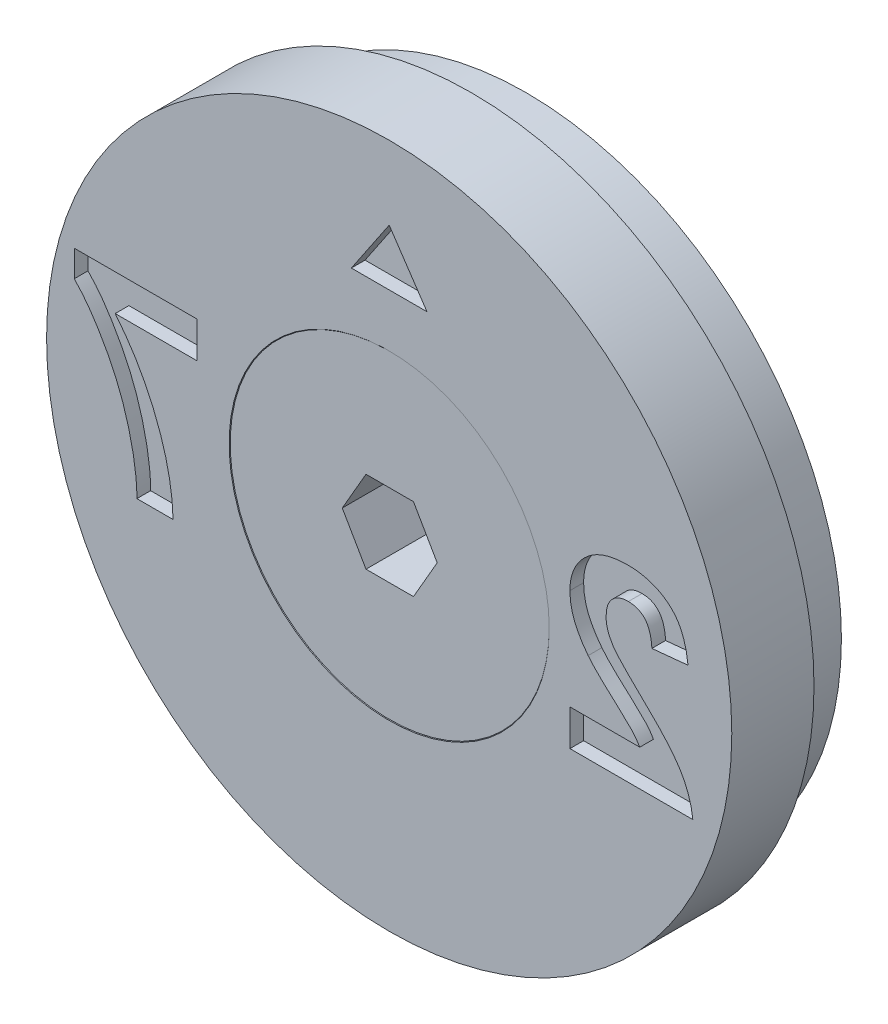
ISO-10303-21;
HEADER;
FILE_DESCRIPTION(('STEP AP214'),'2;1');
FILE_NAME('part.step','',(''),(''),'','','');
FILE_SCHEMA(('AUTOMOTIVE_DESIGN { 1 0 10303 214 1 1 1 1 }'));
ENDSEC;
DATA;
#1=APPLICATION_CONTEXT('core data for automotive mechanical design processes');
#2=APPLICATION_PROTOCOL_DEFINITION('international standard','automotive_design',2000,#1);
#3=PRODUCT_CONTEXT('',#1,'mechanical');
#4=PRODUCT('Part','Part','',(#3));
#5=PRODUCT_RELATED_PRODUCT_CATEGORY('part','',(#4));
#6=PRODUCT_DEFINITION_FORMATION('','',#4);
#7=PRODUCT_DEFINITION_CONTEXT('part definition',#1,'design');
#8=PRODUCT_DEFINITION('design','',#6,#7);
#9=PRODUCT_DEFINITION_SHAPE('','',#8);
#10=(LENGTH_UNIT() NAMED_UNIT(*) SI_UNIT(.MILLI.,.METRE.));
#11=(NAMED_UNIT(*) PLANE_ANGLE_UNIT() SI_UNIT($,.RADIAN.));
#12=(NAMED_UNIT(*) SI_UNIT($,.STERADIAN.) SOLID_ANGLE_UNIT());
#13=UNCERTAINTY_MEASURE_WITH_UNIT(LENGTH_MEASURE(1.E-05),#10,'distance_accuracy_value','');
#14=(GEOMETRIC_REPRESENTATION_CONTEXT(3) GLOBAL_UNCERTAINTY_ASSIGNED_CONTEXT((#13)) GLOBAL_UNIT_ASSIGNED_CONTEXT((#10,
#11,#12)) REPRESENTATION_CONTEXT('',''));
#15=CARTESIAN_POINT('',(0.,0.,0.));
#16=DIRECTION('',(0.,0.,1.));
#17=DIRECTION('',(1.,0.,0.));
#18=AXIS2_PLACEMENT_3D('',#15,#16,#17);
#19=CARTESIAN_POINT('',(0.,0.,-0.0200000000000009));
#20=DIRECTION('',(0.,0.,1.));
#21=DIRECTION('',(1.,0.,0.));
#22=AXIS2_PLACEMENT_3D('',#19,#20,#21);
#23=CYLINDRICAL_SURFACE('',#22,2.5);
#24=CARTESIAN_POINT('',(0.,0.,-3.34));
#25=DIRECTION('',(0.,0.,1.));
#26=DIRECTION('',(1.,0.,0.));
#27=AXIS2_PLACEMENT_3D('',#24,#25,#26);
#28=CIRCLE('',#27,2.5);
#29=CARTESIAN_POINT('',(2.5,0.,-3.34));
#30=VERTEX_POINT('',#29);
#31=EDGE_CURVE('E12',#30,#30,#28,.T.);
#32=ORIENTED_EDGE('',*,*,#31,.F.);
#33=EDGE_LOOP('',(#32));
#34=FACE_BOUND('',#33,.T.);
#35=CARTESIAN_POINT('',(0.,0.,-9.77));
#36=DIRECTION('',(0.,0.,1.));
#37=DIRECTION('',(1.,0.,0.));
#38=AXIS2_PLACEMENT_3D('',#35,#36,#37);
#39=CIRCLE('',#38,2.5);
#40=CARTESIAN_POINT('',(2.5,0.,-9.77));
#41=VERTEX_POINT('',#40);
#42=EDGE_CURVE('E150',#41,#41,#39,.T.);
#43=ORIENTED_EDGE('',*,*,#42,.T.);
#44=EDGE_LOOP('',(#43));
#45=FACE_BOUND('',#44,.T.);
#46=ADVANCED_FACE('F49',(#34,#45),#23,.T.);
#47=CARTESIAN_POINT('',(0.,0.,-3.34));
#48=DIRECTION('',(0.,0.,1.));
#49=DIRECTION('',(1.,0.,0.));
#50=AXIS2_PLACEMENT_3D('',#47,#48,#49);
#51=CONICAL_SURFACE('',#50,2.5,0.785398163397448);
#52=CARTESIAN_POINT('',(0.,0.,-0.0200000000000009));
#53=DIRECTION('',(0.,0.,1.));
#54=DIRECTION('',(1.,0.,0.));
#55=AXIS2_PLACEMENT_3D('',#52,#53,#54);
#56=CIRCLE('',#55,5.82);
#57=CARTESIAN_POINT('',(5.82,0.,-0.0200000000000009));
#58=VERTEX_POINT('',#57);
#59=EDGE_CURVE('E56',#58,#58,#56,.T.);
#60=ORIENTED_EDGE('',*,*,#59,.F.);
#61=EDGE_LOOP('',(#60));
#62=FACE_BOUND('',#61,.T.);
#63=ORIENTED_EDGE('',*,*,#31,.T.);
#64=EDGE_LOOP('',(#63));
#65=FACE_BOUND('',#64,.T.);
#66=ADVANCED_FACE('F165',(#62,#65),#51,.T.);
#67=CARTESIAN_POINT('',(0.,5.82,-0.0200000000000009));
#68=DIRECTION('',(0.,0.,-1.));
#69=DIRECTION('',(-1.,0.,0.));
#70=AXIS2_PLACEMENT_3D('',#67,#68,#69);
#71=PLANE('',#70);
#72=DIRECTION('',(1.,0.,0.));
#73=VECTOR('',#72,1.);
#74=CARTESIAN_POINT('',(-0.866025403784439,-1.5,-0.0200000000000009));
#75=LINE('',#74,#73);
#76=CARTESIAN_POINT('',(-0.866025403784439,-1.5,-0.0200000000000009));
#77=VERTEX_POINT('',#76);
#78=CARTESIAN_POINT('',(0.866025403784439,-1.5,-0.0200000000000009));
#79=VERTEX_POINT('',#78);
#80=EDGE_CURVE('E137',#77,#79,#75,.T.);
#81=ORIENTED_EDGE('',*,*,#80,.F.);
#82=DIRECTION('',(0.5,-0.866025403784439,0.));
#83=VECTOR('',#82,1.);
#84=CARTESIAN_POINT('',(-1.73205080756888,0.,-0.0200000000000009));
#85=LINE('',#84,#83);
#86=CARTESIAN_POINT('',(-1.73205080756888,0.,-0.0200000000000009));
#87=VERTEX_POINT('',#86);
#88=EDGE_CURVE('E63',#87,#77,#85,.T.);
#89=ORIENTED_EDGE('',*,*,#88,.F.);
#90=DIRECTION('',(-0.5,-0.866025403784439,0.));
#91=VECTOR('',#90,1.);
#92=CARTESIAN_POINT('',(-0.866025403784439,1.5,-0.0200000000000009));
#93=LINE('',#92,#91);
#94=CARTESIAN_POINT('',(-0.866025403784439,1.5,-0.0200000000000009));
#95=VERTEX_POINT('',#94);
#96=EDGE_CURVE('E146',#95,#87,#93,.T.);
#97=ORIENTED_EDGE('',*,*,#96,.F.);
#98=DIRECTION('',(-1.,0.,0.));
#99=VECTOR('',#98,1.);
#100=CARTESIAN_POINT('',(0.866025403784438,1.5,-0.0200000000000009));
#101=LINE('',#100,#99);
#102=CARTESIAN_POINT('',(0.866025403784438,1.5,-0.0200000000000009));
#103=VERTEX_POINT('',#102);
#104=EDGE_CURVE('E144',#103,#95,#101,.T.);
#105=ORIENTED_EDGE('',*,*,#104,.F.);
#106=DIRECTION('',(-0.5,0.866025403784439,0.));
#107=VECTOR('',#106,1.);
#108=CARTESIAN_POINT('',(1.73205080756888,0.,-0.0200000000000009));
#109=LINE('',#108,#107);
#110=CARTESIAN_POINT('',(1.73205080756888,0.,-0.0200000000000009));
#111=VERTEX_POINT('',#110);
#112=EDGE_CURVE('E111',#111,#103,#109,.T.);
#113=ORIENTED_EDGE('',*,*,#112,.F.);
#114=DIRECTION('',(0.5,0.866025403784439,0.));
#115=VECTOR('',#114,1.);
#116=CARTESIAN_POINT('',(0.866025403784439,-1.5,-0.0200000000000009));
#117=LINE('',#116,#115);
#118=EDGE_CURVE('E140',#79,#111,#117,.T.);
#119=ORIENTED_EDGE('',*,*,#118,.F.);
#120=EDGE_LOOP('',(#81,#89,#97,#105,#113,#119));
#121=FACE_BOUND('',#120,.T.);
#122=ORIENTED_EDGE('',*,*,#59,.T.);
#123=EDGE_LOOP('',(#122));
#124=FACE_BOUND('',#123,.T.);
#125=ADVANCED_FACE('F163',(#121,#124),#71,.F.);
#126=CARTESIAN_POINT('',(0.,0.,-10.02));
#127=DIRECTION('',(0.,0.,1.));
#128=DIRECTION('',(1.,0.,0.));
#129=AXIS2_PLACEMENT_3D('',#126,#127,#128);
#130=PLANE('',#129);
#131=CARTESIAN_POINT('',(0.,0.,-10.02));
#132=DIRECTION('',(0.,0.,1.));
#133=DIRECTION('',(1.,0.,0.));
#134=AXIS2_PLACEMENT_3D('',#131,#132,#133);
#135=CIRCLE('',#134,2.25);
#136=CARTESIAN_POINT('',(2.25,0.,-10.02));
#137=VERTEX_POINT('',#136);
#138=EDGE_CURVE('E158',#137,#137,#135,.T.);
#139=ORIENTED_EDGE('',*,*,#138,.F.);
#140=EDGE_LOOP('',(#139));
#141=FACE_BOUND('',#140,.T.);
#142=ADVANCED_FACE('F178',(#141),#130,.F.);
#143=CARTESIAN_POINT('',(0.,0.,-10.02));
#144=DIRECTION('',(0.,0.,1.));
#145=DIRECTION('',(1.,0.,0.));
#146=AXIS2_PLACEMENT_3D('',#143,#144,#145);
#147=CONICAL_SURFACE('',#146,2.25,0.78539816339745);
#148=ORIENTED_EDGE('',*,*,#42,.F.);
#149=EDGE_LOOP('',(#148));
#150=FACE_BOUND('',#149,.T.);
#151=ORIENTED_EDGE('',*,*,#138,.T.);
#152=EDGE_LOOP('',(#151));
#153=FACE_BOUND('',#152,.T.);
#154=ADVANCED_FACE('F174',(#150,#153),#147,.T.);
#155=CARTESIAN_POINT('',(-1.73205080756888,0.,-2.52));
#156=DIRECTION('',(-0.866025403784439,-0.5,0.));
#157=DIRECTION('',(0.5,-0.866025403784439,0.));
#158=AXIS2_PLACEMENT_3D('',#155,#156,#157);
#159=PLANE('',#158);
#160=ORIENTED_EDGE('',*,*,#88,.T.);
#161=DIRECTION('',(0.,0.,1.));
#162=VECTOR('',#161,1.);
#163=CARTESIAN_POINT('',(-0.866025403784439,-1.5,-2.52));
#164=LINE('',#163,#162);
#165=CARTESIAN_POINT('',(-0.866025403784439,-1.5,-2.52));
#166=VERTEX_POINT('',#165);
#167=EDGE_CURVE('E93',#166,#77,#164,.T.);
#168=ORIENTED_EDGE('',*,*,#167,.F.);
#169=DIRECTION('',(0.5,-0.866025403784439,0.));
#170=VECTOR('',#169,1.);
#171=CARTESIAN_POINT('',(-1.73205080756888,0.,-2.52));
#172=LINE('',#171,#170);
#173=CARTESIAN_POINT('',(-1.73205080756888,0.,-2.52));
#174=VERTEX_POINT('',#173);
#175=EDGE_CURVE('E148',#174,#166,#172,.T.);
#176=ORIENTED_EDGE('',*,*,#175,.F.);
#177=DIRECTION('',(0.,0.,1.));
#178=VECTOR('',#177,1.);
#179=CARTESIAN_POINT('',(-1.73205080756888,0.,-2.52));
#180=LINE('',#179,#178);
#181=EDGE_CURVE('E71',#174,#87,#180,.T.);
#182=ORIENTED_EDGE('',*,*,#181,.T.);
#183=EDGE_LOOP('',(#160,#168,#176,#182));
#184=FACE_BOUND('',#183,.T.);
#185=ADVANCED_FACE('F177',(#184),#159,.F.);
#186=CARTESIAN_POINT('',(-0.866025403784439,1.5,-2.52));
#187=DIRECTION('',(-0.866025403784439,0.5,0.));
#188=DIRECTION('',(-0.5,-0.866025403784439,0.));
#189=AXIS2_PLACEMENT_3D('',#186,#187,#188);
#190=PLANE('',#189);
#191=ORIENTED_EDGE('',*,*,#96,.T.);
#192=ORIENTED_EDGE('',*,*,#181,.F.);
#193=DIRECTION('',(-0.5,-0.866025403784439,0.));
#194=VECTOR('',#193,1.);
#195=CARTESIAN_POINT('',(-0.866025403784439,1.5,-2.52));
#196=LINE('',#195,#194);
#197=CARTESIAN_POINT('',(-0.866025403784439,1.5,-2.52));
#198=VERTEX_POINT('',#197);
#199=EDGE_CURVE('E123',#198,#174,#196,.T.);
#200=ORIENTED_EDGE('',*,*,#199,.F.);
#201=DIRECTION('',(0.,0.,1.));
#202=VECTOR('',#201,1.);
#203=CARTESIAN_POINT('',(-0.866025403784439,1.5,-2.52));
#204=LINE('',#203,#202);
#205=EDGE_CURVE('E115',#198,#95,#204,.T.);
#206=ORIENTED_EDGE('',*,*,#205,.T.);
#207=EDGE_LOOP('',(#191,#192,#200,#206));
#208=FACE_BOUND('',#207,.T.);
#209=ADVANCED_FACE('F192',(#208),#190,.F.);
#210=CARTESIAN_POINT('',(0.866025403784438,1.5,-2.52));
#211=DIRECTION('',(0.,1.,0.));
#212=DIRECTION('',(-1.,0.,0.));
#213=AXIS2_PLACEMENT_3D('',#210,#211,#212);
#214=PLANE('',#213);
#215=ORIENTED_EDGE('',*,*,#104,.T.);
#216=ORIENTED_EDGE('',*,*,#205,.F.);
#217=DIRECTION('',(-1.,0.,0.));
#218=VECTOR('',#217,1.);
#219=CARTESIAN_POINT('',(0.866025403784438,1.5,-2.52));
#220=LINE('',#219,#218);
#221=CARTESIAN_POINT('',(0.866025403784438,1.5,-2.52));
#222=VERTEX_POINT('',#221);
#223=EDGE_CURVE('E119',#222,#198,#220,.T.);
#224=ORIENTED_EDGE('',*,*,#223,.F.);
#225=DIRECTION('',(0.,0.,1.));
#226=VECTOR('',#225,1.);
#227=CARTESIAN_POINT('',(0.866025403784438,1.5,-2.52));
#228=LINE('',#227,#226);
#229=EDGE_CURVE('E104',#222,#103,#228,.T.);
#230=ORIENTED_EDGE('',*,*,#229,.T.);
#231=EDGE_LOOP('',(#215,#216,#224,#230));
#232=FACE_BOUND('',#231,.T.);
#233=ADVANCED_FACE('F120',(#232),#214,.F.);
#234=CARTESIAN_POINT('',(1.73205080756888,0.,-2.52));
#235=DIRECTION('',(0.866025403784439,0.5,0.));
#236=DIRECTION('',(-0.5,0.866025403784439,0.));
#237=AXIS2_PLACEMENT_3D('',#234,#235,#236);
#238=PLANE('',#237);
#239=ORIENTED_EDGE('',*,*,#112,.T.);
#240=ORIENTED_EDGE('',*,*,#229,.F.);
#241=DIRECTION('',(-0.5,0.866025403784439,0.));
#242=VECTOR('',#241,1.);
#243=CARTESIAN_POINT('',(1.73205080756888,0.,-2.52));
#244=LINE('',#243,#242);
#245=CARTESIAN_POINT('',(1.73205080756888,0.,-2.52));
#246=VERTEX_POINT('',#245);
#247=EDGE_CURVE('E108',#246,#222,#244,.T.);
#248=ORIENTED_EDGE('',*,*,#247,.F.);
#249=DIRECTION('',(0.,0.,1.));
#250=VECTOR('',#249,1.);
#251=CARTESIAN_POINT('',(1.73205080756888,0.,-2.52));
#252=LINE('',#251,#250);
#253=EDGE_CURVE('E116',#246,#111,#252,.T.);
#254=ORIENTED_EDGE('',*,*,#253,.T.);
#255=EDGE_LOOP('',(#239,#240,#248,#254));
#256=FACE_BOUND('',#255,.T.);
#257=ADVANCED_FACE('F106',(#256),#238,.F.);
#258=CARTESIAN_POINT('',(0.866025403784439,-1.5,-2.52));
#259=DIRECTION('',(0.866025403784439,-0.5,0.));
#260=DIRECTION('',(0.5,0.866025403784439,0.));
#261=AXIS2_PLACEMENT_3D('',#258,#259,#260);
#262=PLANE('',#261);
#263=ORIENTED_EDGE('',*,*,#118,.T.);
#264=ORIENTED_EDGE('',*,*,#253,.F.);
#265=DIRECTION('',(0.5,0.866025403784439,0.));
#266=VECTOR('',#265,1.);
#267=CARTESIAN_POINT('',(0.866025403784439,-1.5,-2.52));
#268=LINE('',#267,#266);
#269=CARTESIAN_POINT('',(0.866025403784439,-1.5,-2.52));
#270=VERTEX_POINT('',#269);
#271=EDGE_CURVE('E129',#270,#246,#268,.T.);
#272=ORIENTED_EDGE('',*,*,#271,.F.);
#273=DIRECTION('',(0.,0.,1.));
#274=VECTOR('',#273,1.);
#275=CARTESIAN_POINT('',(0.866025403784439,-1.5,-2.52));
#276=LINE('',#275,#274);
#277=EDGE_CURVE('E153',#270,#79,#276,.T.);
#278=ORIENTED_EDGE('',*,*,#277,.T.);
#279=EDGE_LOOP('',(#263,#264,#272,#278));
#280=FACE_BOUND('',#279,.T.);
#281=ADVANCED_FACE('F196',(#280),#262,.F.);
#282=CARTESIAN_POINT('',(-0.866025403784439,-1.5,-2.52));
#283=DIRECTION('',(0.,-1.,0.));
#284=DIRECTION('',(0.,0.,-1.));
#285=AXIS2_PLACEMENT_3D('',#282,#283,#284);
#286=PLANE('',#285);
#287=ORIENTED_EDGE('',*,*,#80,.T.);
#288=ORIENTED_EDGE('',*,*,#277,.F.);
#289=DIRECTION('',(1.,0.,0.));
#290=VECTOR('',#289,1.);
#291=CARTESIAN_POINT('',(-0.866025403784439,-1.5,-2.52));
#292=LINE('',#291,#290);
#293=EDGE_CURVE('E131',#166,#270,#292,.T.);
#294=ORIENTED_EDGE('',*,*,#293,.F.);
#295=ORIENTED_EDGE('',*,*,#167,.T.);
#296=EDGE_LOOP('',(#287,#288,#294,#295));
#297=FACE_BOUND('',#296,.T.);
#298=ADVANCED_FACE('F193',(#297),#286,.F.);
#299=CARTESIAN_POINT('',(0.,0.,-2.52));
#300=DIRECTION('',(0.,0.,1.));
#301=DIRECTION('',(1.,0.,0.));
#302=AXIS2_PLACEMENT_3D('',#299,#300,#301);
#303=PLANE('',#302);
#304=ORIENTED_EDGE('',*,*,#175,.T.);
#305=ORIENTED_EDGE('',*,*,#293,.T.);
#306=ORIENTED_EDGE('',*,*,#271,.T.);
#307=ORIENTED_EDGE('',*,*,#247,.T.);
#308=ORIENTED_EDGE('',*,*,#223,.T.);
#309=ORIENTED_EDGE('',*,*,#199,.T.);
#310=EDGE_LOOP('',(#304,#305,#306,#307,#308,#309));
#311=FACE_BOUND('',#310,.T.);
#312=ADVANCED_FACE('F126',(#311),#303,.T.);
#313=CLOSED_SHELL('',(#46,#66,#125,#142,#154,#185,#209,#233,#257,#281,#298,#312));
#314=MANIFOLD_SOLID_BREP('B2',#313);
#315=CARTESIAN_POINT('',(0.,0.,3.12219627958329));
#316=DIRECTION('',(0.,0.,1.));
#317=DIRECTION('',(1.,0.,0.));
#318=AXIS2_PLACEMENT_3D('',#315,#316,#317);
#319=CYLINDRICAL_SURFACE('',#318,12.5);
#320=CARTESIAN_POINT('',(0.,0.,0.));
#321=DIRECTION('',(0.,0.,1.));
#322=DIRECTION('',(1.,0.,0.));
#323=AXIS2_PLACEMENT_3D('',#320,#321,#322);
#324=CIRCLE('',#323,12.5);
#325=CARTESIAN_POINT('',(12.5,0.,0.));
#326=VERTEX_POINT('',#325);
#327=EDGE_CURVE('E47',#326,#326,#324,.T.);
#328=ORIENTED_EDGE('',*,*,#327,.F.);
#329=EDGE_LOOP('',(#328));
#330=FACE_BOUND('',#329,.T.);
#331=CARTESIAN_POINT('',(0.,0.,-3.));
#332=DIRECTION('',(0.,0.,1.));
#333=DIRECTION('',(1.,0.,0.));
#334=AXIS2_PLACEMENT_3D('',#331,#332,#333);
#335=CIRCLE('',#334,12.5);
#336=CARTESIAN_POINT('',(12.5,0.,-3.));
#337=VERTEX_POINT('',#336);
#338=EDGE_CURVE('E611',#337,#337,#335,.T.);
#339=ORIENTED_EDGE('',*,*,#338,.T.);
#340=EDGE_LOOP('',(#339));
#341=FACE_BOUND('',#340,.T.);
#342=ADVANCED_FACE('F308',(#330,#341),#319,.T.);
#343=CARTESIAN_POINT('',(0.,12.5,0.));
#344=DIRECTION('',(0.,0.,-1.));
#345=DIRECTION('',(-1.,0.,0.));
#346=AXIS2_PLACEMENT_3D('',#343,#344,#345);
#347=PLANE('',#346);
#348=DIRECTION('',(0.,-1.,0.));
#349=VECTOR('',#348,1.);
#350=CARTESIAN_POINT('',(6.59423076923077,-2.11015384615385,0.));
#351=LINE('',#350,#349);
#352=CARTESIAN_POINT('',(6.59423076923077,-2.11015384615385,0.));
#353=VERTEX_POINT('',#352);
#354=CARTESIAN_POINT('',(6.59423076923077,-3.429,0.));
#355=VERTEX_POINT('',#354);
#356=EDGE_CURVE('E820',#353,#355,#351,.T.);
#357=ORIENTED_EDGE('',*,*,#356,.F.);
#358=DIRECTION('',(-1.,0.,0.));
#359=VECTOR('',#358,1.);
#360=CARTESIAN_POINT('',(9.14262620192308,-2.11015384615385,0.));
#361=LINE('',#360,#359);
#362=CARTESIAN_POINT('',(9.14262620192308,-2.11015384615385,0.));
#363=VERTEX_POINT('',#362);
#364=EDGE_CURVE('E322',#363,#353,#361,.T.);
#365=ORIENTED_EDGE('',*,*,#364,.F.);
#366=CARTESIAN_POINT('',(7.25914903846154,-0.156612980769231,0.));
#367=CARTESIAN_POINT('',(7.28000828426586,-0.182885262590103,0.));
#368=CARTESIAN_POINT('',(7.3246839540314,-0.239154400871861,0.));
#369=CARTESIAN_POINT('',(7.40068900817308,-0.325434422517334,0.));
#370=CARTESIAN_POINT('',(7.48877232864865,-0.419679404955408,0.));
#371=CARTESIAN_POINT('',(7.58768977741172,-0.523653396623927,0.));
#372=CARTESIAN_POINT('',(7.70070879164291,-0.6336743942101,0.));
#373=CARTESIAN_POINT('',(7.82376294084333,-0.754343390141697,0.));
#374=CARTESIAN_POINT('',(7.96226696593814,-0.87948776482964,0.));
#375=CARTESIAN_POINT('',(8.10572357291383,-1.0122292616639,0.));
#376=CARTESIAN_POINT('',(8.24980374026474,-1.14142469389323,0.));
#377=CARTESIAN_POINT('',(8.38223418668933,-1.2641317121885,0.));
#378=CARTESIAN_POINT('',(8.50252509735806,-1.37270106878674,0.));
#379=CARTESIAN_POINT('',(8.6050742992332,-1.47312629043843,0.));
#380=CARTESIAN_POINT('',(8.69591371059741,-1.55855342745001,0.));
#381=CARTESIAN_POINT('',(8.77176917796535,-1.63336308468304,0.));
#382=CARTESIAN_POINT('',(8.83406013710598,-1.69574418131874,0.));
#383=CARTESIAN_POINT('',(8.91989306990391,-1.79298048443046,0.));
#384=CARTESIAN_POINT('',(9.02910573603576,-1.92449262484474,0.));
#385=CARTESIAN_POINT('',(9.10594131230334,-2.05015619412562,0.));
#386=CARTESIAN_POINT('',(9.14262620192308,-2.11015384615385,0.));
#387=B_SPLINE_CURVE_WITH_KNOTS('',3,(#366,#367,#368,#369,#370,#371,#372,#373,#374,#375,#376,
#377,#378,#379,#380,#381,#382,#383,#384,#385,#386),.UNSPECIFIED.,.F.,.F.,(4,1,1,1,1,1,1,1,1,1,1,
1,1,1,1,1,1,1,4),(0.,0.0369753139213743,0.0791925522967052,0.126700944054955,0.179184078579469,
0.237368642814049,0.300558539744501,0.369153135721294,0.443112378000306,0.516018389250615,
0.582473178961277,0.642136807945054,0.694619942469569,0.740679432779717,0.779589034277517,
0.812073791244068,0.837814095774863,0.922564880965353,1.),.UNSPECIFIED.);
#388=CARTESIAN_POINT('',(7.25914903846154,-0.156612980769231,0.));
#389=VERTEX_POINT('',#388);
#390=EDGE_CURVE('E483',#389,#363,#387,.T.);
#391=ORIENTED_EDGE('',*,*,#390,.F.);
#392=CARTESIAN_POINT('',(6.59423076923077,1.56338221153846,0.));
#393=CARTESIAN_POINT('',(6.59590865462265,1.48862686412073,0.));
#394=CARTESIAN_POINT('',(6.59923732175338,1.34032372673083,0.));
#395=CARTESIAN_POINT('',(6.63110683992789,1.12108738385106,0.));
#396=CARTESIAN_POINT('',(6.67979725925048,0.906906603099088,0.));
#397=CARTESIAN_POINT('',(6.75175786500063,0.69725794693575,0.));
#398=CARTESIAN_POINT('',(6.84297351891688,0.487112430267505,0.));
#399=CARTESIAN_POINT('',(6.96055268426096,0.275998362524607,0.));
#400=CARTESIAN_POINT('',(7.09707098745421,0.0575489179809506,0.));
#401=CARTESIAN_POINT('',(7.20395943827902,-0.0836881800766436,0.));
#402=CARTESIAN_POINT('',(7.25914903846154,-0.156612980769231,0.));
#403=B_SPLINE_CURVE_WITH_KNOTS('',3,(#392,#393,#394,#395,#396,#397,#398,#399,#400,#401,#402),
.UNSPECIFIED.,.F.,.F.,(4,1,1,1,1,1,1,1,4),(0.,0.119176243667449,0.236427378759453,
0.352663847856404,0.469086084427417,0.589462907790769,0.717601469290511,0.854189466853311,1.),.UNSPECIFIED.);
#404=CARTESIAN_POINT('',(6.59423076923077,1.56338221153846,0.));
#405=VERTEX_POINT('',#404);
#406=EDGE_CURVE('E486',#405,#389,#403,.T.);
#407=ORIENTED_EDGE('',*,*,#406,.F.);
#408=CARTESIAN_POINT('',(8.69888942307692,3.429,0.));
#409=CARTESIAN_POINT('',(8.6191501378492,3.42746745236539,0.));
#410=CARTESIAN_POINT('',(8.46384786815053,3.42448262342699,0.));
#411=CARTESIAN_POINT('',(8.23713412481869,3.39983388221,0.));
#412=CARTESIAN_POINT('',(8.02415285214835,3.35685523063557,0.));
#413=CARTESIAN_POINT('',(7.82304201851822,3.2999239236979,0.));
#414=CARTESIAN_POINT('',(7.63586692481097,3.22391646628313,0.));
#415=CARTESIAN_POINT('',(7.46106784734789,3.13202661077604,0.));
#416=CARTESIAN_POINT('',(7.30139581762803,3.02076695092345,0.));
#417=CARTESIAN_POINT('',(7.15447070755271,2.89620494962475,0.));
#418=CARTESIAN_POINT('',(7.02313141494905,2.75922713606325,0.));
#419=CARTESIAN_POINT('',(6.90809007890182,2.61311713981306,0.));
#420=CARTESIAN_POINT('',(6.81170882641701,2.45797675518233,0.));
#421=CARTESIAN_POINT('',(6.73083015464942,2.29569697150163,0.));
#422=CARTESIAN_POINT('',(6.67077828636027,2.12366647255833,0.));
#423=CARTESIAN_POINT('',(6.62702188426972,1.94426396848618,0.));
#424=CARTESIAN_POINT('',(6.59800962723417,1.75665250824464,0.));
#425=CARTESIAN_POINT('',(6.59550431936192,1.62851813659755,0.));
#426=CARTESIAN_POINT('',(6.59423076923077,1.56338221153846,0.));
#427=B_SPLINE_CURVE_WITH_KNOTS('',3,(#408,#409,#410,#411,#412,#413,#414,#415,#416,#417,#418,
#419,#420,#421,#422,#423,#424,#425,#426),.UNSPECIFIED.,.F.,.F.,(4,1,1,1,1,1,1,1,1,1,1,1,1,1,1,1,
4),(0.,0.0756723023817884,0.147381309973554,0.216084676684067,0.28169803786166,
0.345459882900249,0.407485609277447,0.468731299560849,0.529782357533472,0.590032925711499,
0.648548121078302,0.70595351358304,0.763101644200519,0.820289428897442,0.878479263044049,
0.938226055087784,1.),.UNSPECIFIED.);
#428=CARTESIAN_POINT('',(8.69888942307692,3.429,0.));
#429=VERTEX_POINT('',#428);
#430=EDGE_CURVE('E755',#429,#405,#427,.T.);
#431=ORIENTED_EDGE('',*,*,#430,.F.);
#432=CARTESIAN_POINT('',(10.9024615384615,1.36006009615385,0.));
#433=CARTESIAN_POINT('',(10.891858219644,1.4490988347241,0.));
#434=CARTESIAN_POINT('',(10.8713000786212,1.62173072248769,0.));
#435=CARTESIAN_POINT('',(10.8199968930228,1.86968963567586,0.));
#436=CARTESIAN_POINT('',(10.7550233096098,2.09844292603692,0.));
#437=CARTESIAN_POINT('',(10.6732818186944,2.3075660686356,0.));
#438=CARTESIAN_POINT('',(10.5781508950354,2.49838888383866,0.));
#439=CARTESIAN_POINT('',(10.4647780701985,2.66804795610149,0.));
#440=CARTESIAN_POINT('',(10.3371247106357,2.81842262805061,0.));
#441=CARTESIAN_POINT('',(10.1950804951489,2.94943286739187,0.));
#442=CARTESIAN_POINT('',(10.0395484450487,3.06149545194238,0.));
#443=CARTESIAN_POINT('',(9.8763454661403,3.1615285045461,0.));
#444=CARTESIAN_POINT('',(9.70228211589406,3.2435874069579,0.));
#445=CARTESIAN_POINT('',(9.51927483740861,3.311216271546,0.));
#446=CARTESIAN_POINT('',(9.32740633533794,3.36526471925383,0.));
#447=CARTESIAN_POINT('',(9.12578919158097,3.40100082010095,0.));
#448=CARTESIAN_POINT('',(8.91566771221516,3.42613773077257,0.));
#449=CARTESIAN_POINT('',(8.77223791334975,3.4280315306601,0.));
#450=CARTESIAN_POINT('',(8.69888942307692,3.429,0.));
#451=B_SPLINE_CURVE_WITH_KNOTS('',3,(#432,#433,#434,#435,#436,#437,#438,#439,#440,#441,#442,
#443,#444,#445,#446,#447,#448,#449,#450),.UNSPECIFIED.,.F.,.F.,(4,1,1,1,1,1,1,1,1,1,1,1,1,1,1,1,
4),(0.,0.0794357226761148,0.154013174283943,0.224141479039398,0.289934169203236,
0.352732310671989,0.412725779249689,0.470302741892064,0.527168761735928,0.583502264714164,
0.639948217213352,0.696584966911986,0.753726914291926,0.812707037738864,0.872963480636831,
0.93503486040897,1.),.UNSPECIFIED.);
#452=CARTESIAN_POINT('',(10.9024615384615,1.36006009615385,0.));
#453=VERTEX_POINT('',#452);
#454=EDGE_CURVE('E763',#453,#429,#451,.T.);
#455=ORIENTED_EDGE('',*,*,#454,.F.);
#456=DIRECTION('',(0.995240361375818,0.0974506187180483,0.));
#457=VECTOR('',#456,1.);
#458=CARTESIAN_POINT('',(9.58361538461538,1.23092307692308,0.));
#459=LINE('',#458,#457);
#460=CARTESIAN_POINT('',(9.58361538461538,1.23092307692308,0.));
#461=VERTEX_POINT('',#460);
#462=EDGE_CURVE('E771',#461,#453,#459,.T.);
#463=ORIENTED_EDGE('',*,*,#462,.F.);
#464=CARTESIAN_POINT('',(8.72636538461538,2.286,0.));
#465=CARTESIAN_POINT('',(8.78618248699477,2.28328991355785,0.));
#466=CARTESIAN_POINT('',(8.90173621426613,2.27805461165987,0.));
#467=CARTESIAN_POINT('',(9.06596313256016,2.23231973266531,0.));
#468=CARTESIAN_POINT('',(9.2096313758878,2.15314784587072,0.));
#469=CARTESIAN_POINT('',(9.31201700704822,2.0629238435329,0.));
#470=CARTESIAN_POINT('',(9.38118335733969,1.9751875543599,0.));
#471=CARTESIAN_POINT('',(9.4283108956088,1.89873115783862,0.));
#472=CARTESIAN_POINT('',(9.46893115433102,1.81185324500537,0.));
#473=CARTESIAN_POINT('',(9.50492409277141,1.71553191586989,0.));
#474=CARTESIAN_POINT('',(9.53335444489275,1.60866370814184,0.));
#475=CARTESIAN_POINT('',(9.55625048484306,1.49206253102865,0.));
#476=CARTESIAN_POINT('',(9.57470138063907,1.3651009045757,0.));
#477=CARTESIAN_POINT('',(9.58056909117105,1.27677733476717,0.));
#478=CARTESIAN_POINT('',(9.58361538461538,1.23092307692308,0.));
#479=B_SPLINE_CURVE_WITH_KNOTS('',3,(#464,#465,#466,#467,#468,#469,#470,#471,#472,#473,#474,
#475,#476,#477,#478),.UNSPECIFIED.,.F.,.F.,(4,1,1,1,1,1,1,1,1,1,1,1,4),(0.,0.116899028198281,
0.225823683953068,0.330086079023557,0.435451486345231,0.490306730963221,0.548244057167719,
0.610766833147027,0.677675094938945,0.749188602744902,0.826858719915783,0.910111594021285,1.),.UNSPECIFIED.);
#480=CARTESIAN_POINT('',(8.72636538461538,2.286,0.));
#481=VERTEX_POINT('',#480);
#482=EDGE_CURVE('E777',#481,#461,#479,.T.);
#483=ORIENTED_EDGE('',*,*,#482,.F.);
#484=CARTESIAN_POINT('',(7.91307692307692,1.38616225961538,0.));
#485=CARTESIAN_POINT('',(7.91554694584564,1.4545870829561,0.));
#486=CARTESIAN_POINT('',(7.92022003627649,1.58404151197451,0.));
#487=CARTESIAN_POINT('',(7.95940470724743,1.76672564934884,0.));
#488=CARTESIAN_POINT('',(8.02889236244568,1.92376854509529,0.));
#489=CARTESIAN_POINT('',(8.12456407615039,2.05565224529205,0.));
#490=CARTESIAN_POINT('',(8.24554114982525,2.15898261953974,0.));
#491=CARTESIAN_POINT('',(8.38696686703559,2.23533373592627,0.));
#492=CARTESIAN_POINT('',(8.5509114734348,2.27754595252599,0.));
#493=CARTESIAN_POINT('',(8.66614141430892,2.28309817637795,0.));
#494=CARTESIAN_POINT('',(8.72636538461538,2.286,0.));
#495=B_SPLINE_CURVE_WITH_KNOTS('',3,(#484,#485,#486,#487,#488,#489,#490,#491,#492,#493,#494),
.UNSPECIFIED.,.F.,.F.,(4,1,1,1,1,1,1,1,4),(0.,0.149140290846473,0.282161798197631,
0.404655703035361,0.521109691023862,0.63441645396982,0.748796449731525,0.868710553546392,1.),.UNSPECIFIED.);
#496=CARTESIAN_POINT('',(7.91307692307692,1.38616225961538,0.));
#497=VERTEX_POINT('',#496);
#498=EDGE_CURVE('E782',#497,#481,#495,.T.);
#499=ORIENTED_EDGE('',*,*,#498,.F.);
#500=CARTESIAN_POINT('',(8.17409855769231,0.593480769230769,0.));
#501=CARTESIAN_POINT('',(8.13439107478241,0.659439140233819,0.));
#502=CARTESIAN_POINT('',(8.05779994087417,0.786665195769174,0.));
#503=CARTESIAN_POINT('',(7.97381140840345,0.986730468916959,0.));
#504=CARTESIAN_POINT('',(7.9233983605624,1.18675441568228,0.));
#505=CARTESIAN_POINT('',(7.91648032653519,1.32040927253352,0.));
#506=CARTESIAN_POINT('',(7.91307692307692,1.38616225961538,0.));
#507=B_SPLINE_CURVE_WITH_KNOTS('',3,(#500,#501,#502,#503,#504,#505,#506),.UNSPECIFIED.,.F.,.F.,
(4,1,1,1,4),(0.,0.272795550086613,0.526191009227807,0.766904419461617,1.),.UNSPECIFIED.);
#508=CARTESIAN_POINT('',(8.17409855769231,0.593480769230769,0.));
#509=VERTEX_POINT('',#508);
#510=EDGE_CURVE('E790',#509,#497,#507,.T.);
#511=ORIENTED_EDGE('',*,*,#510,.F.);
#512=CARTESIAN_POINT('',(9.22368028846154,-0.513800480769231,0.));
#513=CARTESIAN_POINT('',(9.15587503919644,-0.448349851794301,0.));
#514=CARTESIAN_POINT('',(9.02679381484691,-0.323751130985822,0.));
#515=CARTESIAN_POINT('',(8.84298190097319,-0.145330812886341,0.));
#516=CARTESIAN_POINT('',(8.68139228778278,0.0186881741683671,0.));
#517=CARTESIAN_POINT('',(8.5386463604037,0.164055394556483,0.));
#518=CARTESIAN_POINT('',(8.41804175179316,0.294472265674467,0.));
#519=CARTESIAN_POINT('',(8.31799201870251,0.40789061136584,0.));
#520=CARTESIAN_POINT('',(8.23723004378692,0.504772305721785,0.));
#521=CARTESIAN_POINT('',(8.19348928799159,0.566234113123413,0.));
#522=CARTESIAN_POINT('',(8.17409855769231,0.593480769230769,0.));
#523=B_SPLINE_CURVE_WITH_KNOTS('',3,(#512,#513,#514,#515,#516,#517,#518,#519,#520,#521,#522),
.UNSPECIFIED.,.F.,.F.,(4,1,1,1,1,1,1,1,4),(0.,0.18509006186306,0.352356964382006,
0.503079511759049,0.637279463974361,0.752473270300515,0.851885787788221,0.934339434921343,1.),.UNSPECIFIED.);
#524=CARTESIAN_POINT('',(9.22368028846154,-0.513800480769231,0.));
#525=VERTEX_POINT('',#524);
#526=EDGE_CURVE('E798',#525,#509,#523,.T.);
#527=ORIENTED_EDGE('',*,*,#526,.F.);
#528=CARTESIAN_POINT('',(11.0783076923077,-3.429,0.));
#529=CARTESIAN_POINT('',(11.063125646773,-3.31628546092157,0.));
#530=CARTESIAN_POINT('',(11.032770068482,-3.090919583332,0.));
#531=CARTESIAN_POINT('',(10.938921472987,-2.76171676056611,0.));
#532=CARTESIAN_POINT('',(10.8136657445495,-2.44047105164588,0.));
#533=CARTESIAN_POINT('',(10.6777244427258,-2.17905502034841,0.));
#534=CARTESIAN_POINT('',(10.5425157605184,-1.96862411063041,0.));
#535=CARTESIAN_POINT('',(10.4198409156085,-1.79619539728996,0.));
#536=CARTESIAN_POINT('',(10.2734943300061,-1.61273864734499,0.));
#537=CARTESIAN_POINT('',(10.1055996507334,-1.41677285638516,0.));
#538=CARTESIAN_POINT('',(9.91708473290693,-1.20768543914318,0.));
#539=CARTESIAN_POINT('',(9.70654313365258,-0.98625373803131,0.));
#540=CARTESIAN_POINT('',(9.4729705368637,-0.753537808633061,0.));
#541=CARTESIAN_POINT('',(9.3086480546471,-0.595512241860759,0.));
#542=CARTESIAN_POINT('',(9.22368028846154,-0.513800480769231,0.));
#543=B_SPLINE_CURVE_WITH_KNOTS('',3,(#528,#529,#530,#531,#532,#533,#534,#535,#536,#537,#538,
#539,#540,#541,#542),.UNSPECIFIED.,.F.,.F.,(4,1,1,1,1,1,1,1,1,1,1,1,4),(0.,0.0963574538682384,
0.192660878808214,0.289454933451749,0.388479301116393,0.441921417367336,0.501521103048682,
0.567882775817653,0.640891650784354,0.72037065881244,0.806636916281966,0.900015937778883,1.),.UNSPECIFIED.);
#544=CARTESIAN_POINT('',(11.0783076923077,-3.429,0.));
#545=VERTEX_POINT('',#544);
#546=EDGE_CURVE('E806',#545,#525,#543,.T.);
#547=ORIENTED_EDGE('',*,*,#546,.F.);
#548=DIRECTION('',(1.,0.,0.));
#549=VECTOR('',#548,1.);
#550=CARTESIAN_POINT('',(6.59423076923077,-3.429,0.));
#551=LINE('',#550,#549);
#552=EDGE_CURVE('E814',#355,#545,#551,.T.);
#553=ORIENTED_EDGE('',*,*,#552,.F.);
#554=EDGE_LOOP('',(#357,#365,#391,#407,#431,#455,#463,#483,#499,#511,#527,#547,#553));
#555=FACE_BOUND('',#554,.T.);
#556=DIRECTION('',(0.,1.,0.));
#557=VECTOR('',#556,1.);
#558=CARTESIAN_POINT('',(-7.00571076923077,2.02223076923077,0.));
#559=LINE('',#558,#557);
#560=CARTESIAN_POINT('',(-7.00571076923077,2.02223076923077,0.));
#561=VERTEX_POINT('',#560);
#562=CARTESIAN_POINT('',(-7.00571076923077,3.34107692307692,0.));
#563=VERTEX_POINT('',#562);
#564=EDGE_CURVE('E548',#561,#563,#559,.T.);
#565=ORIENTED_EDGE('',*,*,#564,.F.);
#566=DIRECTION('',(1.,0.,0.));
#567=VECTOR('',#566,1.);
#568=CARTESIAN_POINT('',(-9.99646918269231,2.02223076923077,0.));
#569=LINE('',#568,#567);
#570=CARTESIAN_POINT('',(-9.99646918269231,2.02223076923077,0.));
#571=VERTEX_POINT('',#570);
#572=EDGE_CURVE('E330',#571,#561,#569,.T.);
#573=ORIENTED_EDGE('',*,*,#572,.F.);
#574=CARTESIAN_POINT('',(-7.88494153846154,-3.429,0.));
#575=CARTESIAN_POINT('',(-7.88935146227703,-3.31216571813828,0.));
#576=CARTESIAN_POINT('',(-7.89822030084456,-3.07719921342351,0.));
#577=CARTESIAN_POINT('',(-7.93140261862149,-2.7245221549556,0.));
#578=CARTESIAN_POINT('',(-7.98351901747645,-2.37053188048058,0.));
#579=CARTESIAN_POINT('',(-8.0482510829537,-2.01441025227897,0.));
#580=CARTESIAN_POINT('',(-8.13371354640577,-1.65702423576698,0.));
#581=CARTESIAN_POINT('',(-8.23125240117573,-1.29704996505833,0.));
#582=CARTESIAN_POINT('',(-8.34940605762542,-0.936410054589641,0.));
#583=CARTESIAN_POINT('',(-8.48185313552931,-0.575794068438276,0.));
#584=CARTESIAN_POINT('',(-8.62806774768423,-0.218625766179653,0.));
#585=CARTESIAN_POINT('',(-8.78742110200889,0.1306648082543,0.));
#586=CARTESIAN_POINT('',(-8.95950125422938,0.469898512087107,0.));
#587=CARTESIAN_POINT('',(-9.14207033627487,0.800267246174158,0.));
#588=CARTESIAN_POINT('',(-9.33725227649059,1.12070819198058,0.));
#589=CARTESIAN_POINT('',(-9.54519402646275,1.43087338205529,0.));
#590=CARTESIAN_POINT('',(-9.76294598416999,1.73300644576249,0.));
#591=CARTESIAN_POINT('',(-9.91864123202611,1.92583890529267,0.));
#592=CARTESIAN_POINT('',(-9.99646918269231,2.02223076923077,0.));
#593=B_SPLINE_CURVE_WITH_KNOTS('',3,(#574,#575,#576,#577,#578,#579,#580,#581,#582,#583,#584,
#585,#586,#587,#588,#589,#590,#591,#592),.UNSPECIFIED.,.F.,.F.,(4,1,1,1,1,1,1,1,1,1,1,1,1,1,1,1,
4),(0.,0.0589531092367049,0.118561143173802,0.178522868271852,0.239353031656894,
0.301026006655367,0.363773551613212,0.427382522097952,0.492333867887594,0.557475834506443,
0.621960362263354,0.685889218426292,0.749254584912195,0.812267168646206,0.875035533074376,
0.937533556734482,1.),.UNSPECIFIED.);
#594=CARTESIAN_POINT('',(-7.88494153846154,-3.429,0.));
#595=VERTEX_POINT('',#594);
#596=EDGE_CURVE('E568',#595,#571,#593,.T.);
#597=ORIENTED_EDGE('',*,*,#596,.F.);
#598=DIRECTION('',(1.,0.,0.));
#599=VECTOR('',#598,1.);
#600=CARTESIAN_POINT('',(-9.2037876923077,-3.429,0.));
#601=LINE('',#600,#599);
#602=CARTESIAN_POINT('',(-9.2037876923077,-3.429,0.));
#603=VERTEX_POINT('',#602);
#604=EDGE_CURVE('E562',#603,#595,#601,.T.);
#605=ORIENTED_EDGE('',*,*,#604,.F.);
#606=CARTESIAN_POINT('',(-11.4897876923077,2.37392307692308,0.));
#607=CARTESIAN_POINT('',(-11.4430103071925,2.32632861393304,0.));
#608=CARTESIAN_POINT('',(-11.3468494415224,2.2284880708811,0.));
#609=CARTESIAN_POINT('',(-11.2091084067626,2.06836229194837,0.));
#610=CARTESIAN_POINT('',(-11.0693265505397,1.89459772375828,0.));
#611=CARTESIAN_POINT('',(-10.9304268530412,1.70485289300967,0.));
#612=CARTESIAN_POINT('',(-10.7880916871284,1.50212515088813,0.));
#613=CARTESIAN_POINT('',(-10.6485761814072,1.28252833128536,0.));
#614=CARTESIAN_POINT('',(-10.5070762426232,1.04891126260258,0.));
#615=CARTESIAN_POINT('',(-10.3165725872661,0.718459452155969,0.));
#616=CARTESIAN_POINT('',(-10.0938975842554,0.286787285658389,0.));
#617=CARTESIAN_POINT('',(-9.85831921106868,-0.249803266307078,0.));
#618=CARTESIAN_POINT('',(-9.65761722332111,-0.802873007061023,0.));
#619=CARTESIAN_POINT('',(-9.52018531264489,-1.27412919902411,0.));
#620=CARTESIAN_POINT('',(-9.42732793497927,-1.65184031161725,0.));
#621=CARTESIAN_POINT('',(-9.36665941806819,-1.92803162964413,0.));
#622=CARTESIAN_POINT('',(-9.31558940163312,-2.19645056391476,0.));
#623=CARTESIAN_POINT('',(-9.27404397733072,-2.45756885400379,0.));
#624=CARTESIAN_POINT('',(-9.24303745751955,-2.71150562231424,0.));
#625=CARTESIAN_POINT('',(-9.21853701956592,-2.95737801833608,0.));
#626=CARTESIAN_POINT('',(-9.20644953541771,-3.19578560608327,0.));
#627=CARTESIAN_POINT('',(-9.20466590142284,-3.35205669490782,0.));
#628=CARTESIAN_POINT('',(-9.2037876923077,-3.429,0.));
#629=B_SPLINE_CURVE_WITH_KNOTS('',3,(#606,#607,#608,#609,#610,#611,#612,#613,#614,#615,#616,
#617,#618,#619,#620,#621,#622,#623,#624,#625,#626,#627,#628),.UNSPECIFIED.,.F.,.F.,(4,1,1,1,1,1,
1,1,1,1,1,1,1,1,1,1,1,1,1,1,4),(0.,0.0314272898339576,0.0646054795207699,0.0994393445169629,
0.136456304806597,0.175351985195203,0.216100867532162,0.258977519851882,0.304007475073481,
0.395756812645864,0.487615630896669,0.579873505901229,0.672707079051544,0.718694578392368,
0.76307923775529,0.80589344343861,0.847386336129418,0.88760014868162,0.926386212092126,
0.963754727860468,1.),.UNSPECIFIED.);
#630=CARTESIAN_POINT('',(-11.4897876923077,2.37392307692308,0.));
#631=VERTEX_POINT('',#630);
#632=EDGE_CURVE('E557',#631,#603,#629,.T.);
#633=ORIENTED_EDGE('',*,*,#632,.F.);
#634=DIRECTION('',(0.,-1.,0.));
#635=VECTOR('',#634,1.);
#636=CARTESIAN_POINT('',(-11.4897876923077,3.34107692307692,0.));
#637=LINE('',#636,#635);
#638=CARTESIAN_POINT('',(-11.4897876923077,3.34107692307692,0.));
#639=VERTEX_POINT('',#638);
#640=EDGE_CURVE('E554',#639,#631,#637,.T.);
#641=ORIENTED_EDGE('',*,*,#640,.F.);
#642=DIRECTION('',(-1.,0.,0.));
#643=VECTOR('',#642,1.);
#644=CARTESIAN_POINT('',(-7.00571076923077,3.34107692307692,0.));
#645=LINE('',#644,#643);
#646=EDGE_CURVE('E551',#563,#639,#645,.T.);
#647=ORIENTED_EDGE('',*,*,#646,.F.);
#648=EDGE_LOOP('',(#565,#573,#597,#605,#633,#641,#647));
#649=FACE_BOUND('',#648,.T.);
#650=DIRECTION('',(-0.559192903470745,0.829037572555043,0.));
#651=VECTOR('',#650,1.);
#652=CARTESIAN_POINT('',(1.3800444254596,7.76799984,0.));
#653=LINE('',#652,#651);
#654=CARTESIAN_POINT('',(1.3800444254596,7.76799984,0.));
#655=VERTEX_POINT('',#654);
#656=CARTESIAN_POINT('',(0.,9.81399984,0.));
#657=VERTEX_POINT('',#656);
#658=EDGE_CURVE('E603',#655,#657,#653,.T.);
#659=ORIENTED_EDGE('',*,*,#658,.F.);
#660=DIRECTION('',(1.,0.,0.));
#661=VECTOR('',#660,1.);
#662=CARTESIAN_POINT('',(-1.3800444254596,7.76799984,0.));
#663=LINE('',#662,#661);
#664=CARTESIAN_POINT('',(-1.3800444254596,7.76799984,0.));
#665=VERTEX_POINT('',#664);
#666=EDGE_CURVE('E601',#665,#655,#663,.T.);
#667=ORIENTED_EDGE('',*,*,#666,.F.);
#668=DIRECTION('',(-0.559192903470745,-0.829037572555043,0.));
#669=VECTOR('',#668,1.);
#670=CARTESIAN_POINT('',(0.,9.81399984,0.));
#671=LINE('',#670,#669);
#672=EDGE_CURVE('E594',#657,#665,#671,.T.);
#673=ORIENTED_EDGE('',*,*,#672,.F.);
#674=EDGE_LOOP('',(#659,#667,#673));
#675=FACE_BOUND('',#674,.T.);
#676=CARTESIAN_POINT('',(0.,0.,0.));
#677=DIRECTION('',(0.,0.,1.));
#678=DIRECTION('',(1.,0.,0.));
#679=AXIS2_PLACEMENT_3D('',#676,#677,#678);
#680=CIRCLE('',#679,5.84);
#681=CARTESIAN_POINT('',(5.84,0.,0.));
#682=VERTEX_POINT('',#681);
#683=EDGE_CURVE('E315',#682,#682,#680,.T.);
#684=ORIENTED_EDGE('',*,*,#683,.F.);
#685=EDGE_LOOP('',(#684));
#686=FACE_BOUND('',#685,.T.);
#687=ORIENTED_EDGE('',*,*,#327,.T.);
#688=EDGE_LOOP('',(#687));
#689=FACE_BOUND('',#688,.T.);
#690=ADVANCED_FACE('F634',(#555,#649,#675,#686,#689),#347,.F.);
#691=CARTESIAN_POINT('',(0.,0.,0.));
#692=DIRECTION('',(0.,0.,1.));
#693=DIRECTION('',(1.,0.,0.));
#694=AXIS2_PLACEMENT_3D('',#691,#692,#693);
#695=CONICAL_SURFACE('',#694,5.84,0.785398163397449);
#696=CARTESIAN_POINT('',(0.,0.,-3.34));
#697=DIRECTION('',(0.,0.,1.));
#698=DIRECTION('',(1.,0.,0.));
#699=AXIS2_PLACEMENT_3D('',#696,#697,#698);
#700=CIRCLE('',#699,2.5);
#701=CARTESIAN_POINT('',(2.5,0.,-3.34));
#702=VERTEX_POINT('',#701);
#703=EDGE_CURVE('E627',#702,#702,#700,.T.);
#704=ORIENTED_EDGE('',*,*,#703,.F.);
#705=EDGE_LOOP('',(#704));
#706=FACE_BOUND('',#705,.T.);
#707=ORIENTED_EDGE('',*,*,#683,.T.);
#708=EDGE_LOOP('',(#707));
#709=FACE_BOUND('',#708,.T.);
#710=ADVANCED_FACE('F632',(#706,#709),#695,.F.);
#711=CARTESIAN_POINT('',(0.,0.,3.12219627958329));
#712=DIRECTION('',(0.,0.,1.));
#713=DIRECTION('',(1.,0.,0.));
#714=AXIS2_PLACEMENT_3D('',#711,#712,#713);
#715=CYLINDRICAL_SURFACE('',#714,2.5);
#716=CARTESIAN_POINT('',(0.,0.,-5.));
#717=DIRECTION('',(0.,0.,1.));
#718=DIRECTION('',(1.,0.,0.));
#719=AXIS2_PLACEMENT_3D('',#716,#717,#718);
#720=CIRCLE('',#719,2.5);
#721=CARTESIAN_POINT('',(2.5,0.,-5.));
#722=VERTEX_POINT('',#721);
#723=EDGE_CURVE('E624',#722,#722,#720,.T.);
#724=ORIENTED_EDGE('',*,*,#723,.F.);
#725=EDGE_LOOP('',(#724));
#726=FACE_BOUND('',#725,.T.);
#727=ORIENTED_EDGE('',*,*,#703,.T.);
#728=EDGE_LOOP('',(#727));
#729=FACE_BOUND('',#728,.T.);
#730=ADVANCED_FACE('F660',(#726,#729),#715,.F.);
#731=CARTESIAN_POINT('',(0.,2.5,-5.));
#732=DIRECTION('',(0.,0.,1.));
#733=DIRECTION('',(1.,0.,0.));
#734=AXIS2_PLACEMENT_3D('',#731,#732,#733);
#735=PLANE('',#734);
#736=CARTESIAN_POINT('',(0.,0.,-5.));
#737=DIRECTION('',(0.,0.,1.));
#738=DIRECTION('',(1.,0.,0.));
#739=AXIS2_PLACEMENT_3D('',#736,#737,#738);
#740=CIRCLE('',#739,11.5);
#741=CARTESIAN_POINT('',(11.5,0.,-5.));
#742=VERTEX_POINT('',#741);
#743=EDGE_CURVE('E621',#742,#742,#740,.T.);
#744=ORIENTED_EDGE('',*,*,#743,.F.);
#745=EDGE_LOOP('',(#744));
#746=FACE_BOUND('',#745,.T.);
#747=ORIENTED_EDGE('',*,*,#723,.T.);
#748=EDGE_LOOP('',(#747));
#749=FACE_BOUND('',#748,.T.);
#750=ADVANCED_FACE('F654',(#746,#749),#735,.F.);
#751=CARTESIAN_POINT('',(0.,0.,3.12219627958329));
#752=DIRECTION('',(0.,0.,1.));
#753=DIRECTION('',(1.,0.,0.));
#754=AXIS2_PLACEMENT_3D('',#751,#752,#753);
#755=CYLINDRICAL_SURFACE('',#754,11.5);
#756=CARTESIAN_POINT('',(0.,0.,-3.));
#757=DIRECTION('',(0.,0.,1.));
#758=DIRECTION('',(1.,0.,0.));
#759=AXIS2_PLACEMENT_3D('',#756,#757,#758);
#760=CIRCLE('',#759,11.5);
#761=CARTESIAN_POINT('',(11.5,0.,-3.));
#762=VERTEX_POINT('',#761);
#763=EDGE_CURVE('E618',#762,#762,#760,.T.);
#764=ORIENTED_EDGE('',*,*,#763,.F.);
#765=EDGE_LOOP('',(#764));
#766=FACE_BOUND('',#765,.T.);
#767=ORIENTED_EDGE('',*,*,#743,.T.);
#768=EDGE_LOOP('',(#767));
#769=FACE_BOUND('',#768,.T.);
#770=ADVANCED_FACE('F648',(#766,#769),#755,.T.);
#771=CARTESIAN_POINT('',(0.,11.5,-3.));
#772=DIRECTION('',(0.,0.,1.));
#773=DIRECTION('',(1.,0.,0.));
#774=AXIS2_PLACEMENT_3D('',#771,#772,#773);
#775=PLANE('',#774);
#776=ORIENTED_EDGE('',*,*,#338,.F.);
#777=EDGE_LOOP('',(#776));
#778=FACE_BOUND('',#777,.T.);
#779=ORIENTED_EDGE('',*,*,#763,.T.);
#780=EDGE_LOOP('',(#779));
#781=FACE_BOUND('',#780,.T.);
#782=ADVANCED_FACE('F644',(#778,#781),#775,.F.);
#783=CARTESIAN_POINT('',(-1.3800444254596,7.76799984,-0.5));
#784=DIRECTION('',(0.,-1.,0.));
#785=DIRECTION('',(0.,0.,-1.));
#786=AXIS2_PLACEMENT_3D('',#783,#784,#785);
#787=PLANE('',#786);
#788=ORIENTED_EDGE('',*,*,#666,.T.);
#789=DIRECTION('',(0.,0.,1.));
#790=VECTOR('',#789,1.);
#791=CARTESIAN_POINT('',(1.3800444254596,7.76799984,-0.5));
#792=LINE('',#791,#790);
#793=CARTESIAN_POINT('',(1.3800444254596,7.76799984,-0.5));
#794=VERTEX_POINT('',#793);
#795=EDGE_CURVE('E600',#794,#655,#792,.T.);
#796=ORIENTED_EDGE('',*,*,#795,.F.);
#797=DIRECTION('',(1.,0.,0.));
#798=VECTOR('',#797,1.);
#799=CARTESIAN_POINT('',(-1.3800444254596,7.76799984,-0.5));
#800=LINE('',#799,#798);
#801=CARTESIAN_POINT('',(-1.3800444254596,7.76799984,-0.5));
#802=VERTEX_POINT('',#801);
#803=EDGE_CURVE('E590',#802,#794,#800,.T.);
#804=ORIENTED_EDGE('',*,*,#803,.F.);
#805=DIRECTION('',(0.,0.,1.));
#806=VECTOR('',#805,1.);
#807=CARTESIAN_POINT('',(-1.3800444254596,7.76799984,-0.5));
#808=LINE('',#807,#806);
#809=EDGE_CURVE('E609',#802,#665,#808,.T.);
#810=ORIENTED_EDGE('',*,*,#809,.T.);
#811=EDGE_LOOP('',(#788,#796,#804,#810));
#812=FACE_BOUND('',#811,.T.);
#813=ADVANCED_FACE('F647',(#812),#787,.F.);
#814=CARTESIAN_POINT('',(0.,9.81399984,-0.5));
#815=DIRECTION('',(-0.829037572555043,0.559192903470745,0.));
#816=DIRECTION('',(-0.559192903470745,-0.829037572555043,0.));
#817=AXIS2_PLACEMENT_3D('',#814,#815,#816);
#818=PLANE('',#817);
#819=ORIENTED_EDGE('',*,*,#672,.T.);
#820=ORIENTED_EDGE('',*,*,#809,.F.);
#821=DIRECTION('',(-0.559192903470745,-0.829037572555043,0.));
#822=VECTOR('',#821,1.);
#823=CARTESIAN_POINT('',(0.,9.81399984,-0.5));
#824=LINE('',#823,#822);
#825=CARTESIAN_POINT('',(0.,9.81399984,-0.5));
#826=VERTEX_POINT('',#825);
#827=EDGE_CURVE('E597',#826,#802,#824,.T.);
#828=ORIENTED_EDGE('',*,*,#827,.F.);
#829=DIRECTION('',(0.,0.,1.));
#830=VECTOR('',#829,1.);
#831=CARTESIAN_POINT('',(0.,9.81399984,-0.5));
#832=LINE('',#831,#830);
#833=EDGE_CURVE('E612',#826,#657,#832,.T.);
#834=ORIENTED_EDGE('',*,*,#833,.T.);
#835=EDGE_LOOP('',(#819,#820,#828,#834));
#836=FACE_BOUND('',#835,.T.);
#837=ADVANCED_FACE('F676',(#836),#818,.F.);
#838=CARTESIAN_POINT('',(1.3800444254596,7.76799984,-0.5));
#839=DIRECTION('',(0.829037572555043,0.559192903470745,0.));
#840=DIRECTION('',(-0.559192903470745,0.829037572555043,0.));
#841=AXIS2_PLACEMENT_3D('',#838,#839,#840);
#842=PLANE('',#841);
#843=ORIENTED_EDGE('',*,*,#658,.T.);
#844=ORIENTED_EDGE('',*,*,#833,.F.);
#845=DIRECTION('',(-0.559192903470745,0.829037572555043,0.));
#846=VECTOR('',#845,1.);
#847=CARTESIAN_POINT('',(1.3800444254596,7.76799984,-0.5));
#848=LINE('',#847,#846);
#849=EDGE_CURVE('E593',#794,#826,#848,.T.);
#850=ORIENTED_EDGE('',*,*,#849,.F.);
#851=ORIENTED_EDGE('',*,*,#795,.T.);
#852=EDGE_LOOP('',(#843,#844,#850,#851));
#853=FACE_BOUND('',#852,.T.);
#854=ADVANCED_FACE('F678',(#853),#842,.F.);
#855=CARTESIAN_POINT('',(1.3800444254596,7.76799984,-0.5));
#856=DIRECTION('',(0.,0.,1.));
#857=DIRECTION('',(1.,0.,0.));
#858=AXIS2_PLACEMENT_3D('',#855,#856,#857);
#859=PLANE('',#858);
#860=ORIENTED_EDGE('',*,*,#803,.T.);
#861=ORIENTED_EDGE('',*,*,#849,.T.);
#862=ORIENTED_EDGE('',*,*,#827,.T.);
#863=EDGE_LOOP('',(#860,#861,#862));
#864=FACE_BOUND('',#863,.T.);
#865=ADVANCED_FACE('F681',(#864),#859,.T.);
#866=CARTESIAN_POINT('',(-9.99646918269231,2.02223076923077,-0.5));
#867=DIRECTION('',(0.,-1.,0.));
#868=DIRECTION('',(0.,0.,-1.));
#869=AXIS2_PLACEMENT_3D('',#866,#867,#868);
#870=PLANE('',#869);
#871=ORIENTED_EDGE('',*,*,#572,.T.);
#872=DIRECTION('',(0.,0.,1.));
#873=VECTOR('',#872,1.);
#874=CARTESIAN_POINT('',(-7.00571076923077,2.02223076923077,-0.5));
#875=LINE('',#874,#873);
#876=CARTESIAN_POINT('',(-7.00571076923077,2.02223076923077,-0.5));
#877=VERTEX_POINT('',#876);
#878=EDGE_CURVE('E541',#877,#561,#875,.T.);
#879=ORIENTED_EDGE('',*,*,#878,.F.);
#880=DIRECTION('',(1.,0.,0.));
#881=VECTOR('',#880,1.);
#882=CARTESIAN_POINT('',(-9.99646918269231,2.02223076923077,-0.5));
#883=LINE('',#882,#881);
#884=CARTESIAN_POINT('',(-9.99646918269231,2.02223076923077,-0.5));
#885=VERTEX_POINT('',#884);
#886=EDGE_CURVE('E573',#885,#877,#883,.T.);
#887=ORIENTED_EDGE('',*,*,#886,.F.);
#888=DIRECTION('',(0.,0.,1.));
#889=VECTOR('',#888,1.);
#890=CARTESIAN_POINT('',(-9.99646918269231,2.02223076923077,-0.5));
#891=LINE('',#890,#889);
#892=EDGE_CURVE('E574',#885,#571,#891,.T.);
#893=ORIENTED_EDGE('',*,*,#892,.T.);
#894=EDGE_LOOP('',(#871,#879,#887,#893));
#895=FACE_BOUND('',#894,.T.);
#896=ADVANCED_FACE('F531',(#895),#870,.F.);
#897=CARTESIAN_POINT('',(-7.88494153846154,-3.429,-0.5));
#898=CARTESIAN_POINT('',(-7.88935146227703,-3.31216571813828,-0.5));
#899=CARTESIAN_POINT('',(-7.89822030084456,-3.07719921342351,-0.5));
#900=CARTESIAN_POINT('',(-7.93140261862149,-2.7245221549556,-0.5));
#901=CARTESIAN_POINT('',(-7.98351901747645,-2.37053188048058,-0.5));
#902=CARTESIAN_POINT('',(-8.0482510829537,-2.01441025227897,-0.5));
#903=CARTESIAN_POINT('',(-8.13371354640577,-1.65702423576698,-0.5));
#904=CARTESIAN_POINT('',(-8.23125240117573,-1.29704996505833,-0.5));
#905=CARTESIAN_POINT('',(-8.34940605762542,-0.936410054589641,-0.5));
#906=CARTESIAN_POINT('',(-8.48185313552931,-0.575794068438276,-0.5));
#907=CARTESIAN_POINT('',(-8.62806774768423,-0.218625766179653,-0.5));
#908=CARTESIAN_POINT('',(-8.78742110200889,0.1306648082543,-0.5));
#909=CARTESIAN_POINT('',(-8.95950125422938,0.469898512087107,-0.5));
#910=CARTESIAN_POINT('',(-9.14207033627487,0.800267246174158,-0.5));
#911=CARTESIAN_POINT('',(-9.33725227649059,1.12070819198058,-0.5));
#912=CARTESIAN_POINT('',(-9.54519402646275,1.43087338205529,-0.5));
#913=CARTESIAN_POINT('',(-9.76294598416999,1.73300644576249,-0.5));
#914=CARTESIAN_POINT('',(-9.91864123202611,1.92583890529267,-0.5));
#915=CARTESIAN_POINT('',(-9.99646918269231,2.02223076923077,-0.5));
#916=B_SPLINE_CURVE_WITH_KNOTS('',3,(#897,#898,#899,#900,#901,#902,#903,#904,#905,#906,#907,
#908,#909,#910,#911,#912,#913,#914,#915),.UNSPECIFIED.,.F.,.F.,(4,1,1,1,1,1,1,1,1,1,1,1,1,1,1,1,
4),(0.,0.0589531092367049,0.118561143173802,0.178522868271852,0.239353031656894,
0.301026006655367,0.363773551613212,0.427382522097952,0.492333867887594,0.557475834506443,
0.621960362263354,0.685889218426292,0.749254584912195,0.812267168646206,0.875035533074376,
0.937533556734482,1.),.UNSPECIFIED.);
#917=DIRECTION('',(0.,0.,1.));
#918=VECTOR('',#917,1.);
#919=SURFACE_OF_LINEAR_EXTRUSION('',#916,#918);
#920=ORIENTED_EDGE('',*,*,#596,.T.);
#921=ORIENTED_EDGE('',*,*,#892,.F.);
#922=CARTESIAN_POINT('',(-7.88494153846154,-3.429,-0.5));
#923=VERTEX_POINT('',#922);
#924=EDGE_CURVE('E534',#923,#885,#916,.T.);
#925=ORIENTED_EDGE('',*,*,#924,.F.);
#926=DIRECTION('',(0.,0.,1.));
#927=VECTOR('',#926,1.);
#928=CARTESIAN_POINT('',(-7.88494153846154,-3.429,-0.5));
#929=LINE('',#928,#927);
#930=EDGE_CURVE('E579',#923,#595,#929,.T.);
#931=ORIENTED_EDGE('',*,*,#930,.T.);
#932=EDGE_LOOP('',(#920,#921,#925,#931));
#933=FACE_BOUND('',#932,.T.);
#934=ADVANCED_FACE('F526',(#933),#919,.F.);
#935=CARTESIAN_POINT('',(-9.2037876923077,-3.429,-0.5));
#936=DIRECTION('',(0.,-1.,0.));
#937=DIRECTION('',(0.,0.,-1.));
#938=AXIS2_PLACEMENT_3D('',#935,#936,#937);
#939=PLANE('',#938);
#940=ORIENTED_EDGE('',*,*,#604,.T.);
#941=ORIENTED_EDGE('',*,*,#930,.F.);
#942=DIRECTION('',(1.,0.,0.));
#943=VECTOR('',#942,1.);
#944=CARTESIAN_POINT('',(-9.2037876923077,-3.429,-0.5));
#945=LINE('',#944,#943);
#946=CARTESIAN_POINT('',(-9.2037876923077,-3.429,-0.5));
#947=VERTEX_POINT('',#946);
#948=EDGE_CURVE('E542',#947,#923,#945,.T.);
#949=ORIENTED_EDGE('',*,*,#948,.F.);
#950=DIRECTION('',(0.,0.,1.));
#951=VECTOR('',#950,1.);
#952=CARTESIAN_POINT('',(-9.2037876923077,-3.429,-0.5));
#953=LINE('',#952,#951);
#954=EDGE_CURVE('E581',#947,#603,#953,.T.);
#955=ORIENTED_EDGE('',*,*,#954,.T.);
#956=EDGE_LOOP('',(#940,#941,#949,#955));
#957=FACE_BOUND('',#956,.T.);
#958=ADVANCED_FACE('F530',(#957),#939,.F.);
#959=CARTESIAN_POINT('',(-11.4897876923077,2.37392307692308,-0.5));
#960=CARTESIAN_POINT('',(-11.4430103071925,2.32632861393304,-0.5));
#961=CARTESIAN_POINT('',(-11.3468494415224,2.2284880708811,-0.5));
#962=CARTESIAN_POINT('',(-11.2091084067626,2.06836229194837,-0.5));
#963=CARTESIAN_POINT('',(-11.0693265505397,1.89459772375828,-0.5));
#964=CARTESIAN_POINT('',(-10.9304268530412,1.70485289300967,-0.5));
#965=CARTESIAN_POINT('',(-10.7880916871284,1.50212515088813,-0.5));
#966=CARTESIAN_POINT('',(-10.6485761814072,1.28252833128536,-0.5));
#967=CARTESIAN_POINT('',(-10.5070762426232,1.04891126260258,-0.5));
#968=CARTESIAN_POINT('',(-10.3165725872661,0.718459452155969,-0.5));
#969=CARTESIAN_POINT('',(-10.0938975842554,0.286787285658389,-0.5));
#970=CARTESIAN_POINT('',(-9.85831921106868,-0.249803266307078,-0.5));
#971=CARTESIAN_POINT('',(-9.65761722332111,-0.802873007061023,-0.5));
#972=CARTESIAN_POINT('',(-9.52018531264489,-1.27412919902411,-0.5));
#973=CARTESIAN_POINT('',(-9.42732793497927,-1.65184031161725,-0.5));
#974=CARTESIAN_POINT('',(-9.36665941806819,-1.92803162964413,-0.5));
#975=CARTESIAN_POINT('',(-9.31558940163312,-2.19645056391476,-0.5));
#976=CARTESIAN_POINT('',(-9.27404397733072,-2.45756885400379,-0.5));
#977=CARTESIAN_POINT('',(-9.24303745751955,-2.71150562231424,-0.5));
#978=CARTESIAN_POINT('',(-9.21853701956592,-2.95737801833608,-0.5));
#979=CARTESIAN_POINT('',(-9.20644953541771,-3.19578560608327,-0.5));
#980=CARTESIAN_POINT('',(-9.20466590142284,-3.35205669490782,-0.5));
#981=CARTESIAN_POINT('',(-9.2037876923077,-3.429,-0.5));
#982=B_SPLINE_CURVE_WITH_KNOTS('',3,(#959,#960,#961,#962,#963,#964,#965,#966,#967,#968,#969,
#970,#971,#972,#973,#974,#975,#976,#977,#978,#979,#980,#981),.UNSPECIFIED.,.F.,.F.,(4,1,1,1,1,1,
1,1,1,1,1,1,1,1,1,1,1,1,1,1,4),(0.,0.0314272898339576,0.0646054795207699,0.0994393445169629,
0.136456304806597,0.175351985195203,0.216100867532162,0.258977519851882,0.304007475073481,
0.395756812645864,0.487615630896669,0.579873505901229,0.672707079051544,0.718694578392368,
0.76307923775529,0.80589344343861,0.847386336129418,0.88760014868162,0.926386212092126,
0.963754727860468,1.),.UNSPECIFIED.);
#983=DIRECTION('',(0.,0.,1.));
#984=VECTOR('',#983,1.);
#985=SURFACE_OF_LINEAR_EXTRUSION('',#982,#984);
#986=ORIENTED_EDGE('',*,*,#632,.T.);
#987=ORIENTED_EDGE('',*,*,#954,.F.);
#988=CARTESIAN_POINT('',(-11.4897876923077,2.37392307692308,-0.5));
#989=VERTEX_POINT('',#988);
#990=EDGE_CURVE('E704',#989,#947,#982,.T.);
#991=ORIENTED_EDGE('',*,*,#990,.F.);
#992=DIRECTION('',(0.,0.,1.));
#993=VECTOR('',#992,1.);
#994=CARTESIAN_POINT('',(-11.4897876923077,2.37392307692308,-0.5));
#995=LINE('',#994,#993);
#996=EDGE_CURVE('E583',#989,#631,#995,.T.);
#997=ORIENTED_EDGE('',*,*,#996,.T.);
#998=EDGE_LOOP('',(#986,#987,#991,#997));
#999=FACE_BOUND('',#998,.T.);
#1000=ADVANCED_FACE('F700',(#999),#985,.F.);
#1001=CARTESIAN_POINT('',(-11.4897876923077,3.34107692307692,-0.5));
#1002=DIRECTION('',(-1.,0.,0.));
#1003=DIRECTION('',(0.,0.,1.));
#1004=AXIS2_PLACEMENT_3D('',#1001,#1002,#1003);
#1005=PLANE('',#1004);
#1006=ORIENTED_EDGE('',*,*,#640,.T.);
#1007=ORIENTED_EDGE('',*,*,#996,.F.);
#1008=DIRECTION('',(0.,-1.,0.));
#1009=VECTOR('',#1008,1.);
#1010=CARTESIAN_POINT('',(-11.4897876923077,3.34107692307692,-0.5));
#1011=LINE('',#1010,#1009);
#1012=CARTESIAN_POINT('',(-11.4897876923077,3.34107692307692,-0.5));
#1013=VERTEX_POINT('',#1012);
#1014=EDGE_CURVE('E710',#1013,#989,#1011,.T.);
#1015=ORIENTED_EDGE('',*,*,#1014,.F.);
#1016=DIRECTION('',(0.,0.,1.));
#1017=VECTOR('',#1016,1.);
#1018=CARTESIAN_POINT('',(-11.4897876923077,3.34107692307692,-0.5));
#1019=LINE('',#1018,#1017);
#1020=EDGE_CURVE('E585',#1013,#639,#1019,.T.);
#1021=ORIENTED_EDGE('',*,*,#1020,.T.);
#1022=EDGE_LOOP('',(#1006,#1007,#1015,#1021));
#1023=FACE_BOUND('',#1022,.T.);
#1024=ADVANCED_FACE('F697',(#1023),#1005,.F.);
#1025=CARTESIAN_POINT('',(-7.00571076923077,3.34107692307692,-0.5));
#1026=DIRECTION('',(0.,1.,0.));
#1027=DIRECTION('',(0.,0.,1.));
#1028=AXIS2_PLACEMENT_3D('',#1025,#1026,#1027);
#1029=PLANE('',#1028);
#1030=ORIENTED_EDGE('',*,*,#646,.T.);
#1031=ORIENTED_EDGE('',*,*,#1020,.F.);
#1032=DIRECTION('',(-1.,0.,0.));
#1033=VECTOR('',#1032,1.);
#1034=CARTESIAN_POINT('',(-7.00571076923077,3.34107692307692,-0.5));
#1035=LINE('',#1034,#1033);
#1036=CARTESIAN_POINT('',(-7.00571076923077,3.34107692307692,-0.5));
#1037=VERTEX_POINT('',#1036);
#1038=EDGE_CURVE('E716',#1037,#1013,#1035,.T.);
#1039=ORIENTED_EDGE('',*,*,#1038,.F.);
#1040=DIRECTION('',(0.,0.,1.));
#1041=VECTOR('',#1040,1.);
#1042=CARTESIAN_POINT('',(-7.00571076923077,3.34107692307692,-0.5));
#1043=LINE('',#1042,#1041);
#1044=EDGE_CURVE('E587',#1037,#563,#1043,.T.);
#1045=ORIENTED_EDGE('',*,*,#1044,.T.);
#1046=EDGE_LOOP('',(#1030,#1031,#1039,#1045));
#1047=FACE_BOUND('',#1046,.T.);
#1048=ADVANCED_FACE('F693',(#1047),#1029,.F.);
#1049=CARTESIAN_POINT('',(-7.00571076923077,2.02223076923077,-0.5));
#1050=DIRECTION('',(1.,0.,0.));
#1051=DIRECTION('',(0.,0.,-1.));
#1052=AXIS2_PLACEMENT_3D('',#1049,#1050,#1051);
#1053=PLANE('',#1052);
#1054=ORIENTED_EDGE('',*,*,#564,.T.);
#1055=ORIENTED_EDGE('',*,*,#1044,.F.);
#1056=DIRECTION('',(0.,1.,0.));
#1057=VECTOR('',#1056,1.);
#1058=CARTESIAN_POINT('',(-7.00571076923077,2.02223076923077,-0.5));
#1059=LINE('',#1058,#1057);
#1060=EDGE_CURVE('E719',#877,#1037,#1059,.T.);
#1061=ORIENTED_EDGE('',*,*,#1060,.F.);
#1062=ORIENTED_EDGE('',*,*,#878,.T.);
#1063=EDGE_LOOP('',(#1054,#1055,#1061,#1062));
#1064=FACE_BOUND('',#1063,.T.);
#1065=ADVANCED_FACE('F524',(#1064),#1053,.F.);
#1066=CARTESIAN_POINT('',(-9.8355766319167,-0.324762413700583,-0.5));
#1067=DIRECTION('',(0.,0.,1.));
#1068=DIRECTION('',(1.,0.,0.));
#1069=AXIS2_PLACEMENT_3D('',#1066,#1067,#1068);
#1070=PLANE('',#1069);
#1071=ORIENTED_EDGE('',*,*,#886,.T.);
#1072=ORIENTED_EDGE('',*,*,#1060,.T.);
#1073=ORIENTED_EDGE('',*,*,#1038,.T.);
#1074=ORIENTED_EDGE('',*,*,#1014,.T.);
#1075=ORIENTED_EDGE('',*,*,#990,.T.);
#1076=ORIENTED_EDGE('',*,*,#948,.T.);
#1077=ORIENTED_EDGE('',*,*,#924,.T.);
#1078=EDGE_LOOP('',(#1071,#1072,#1073,#1074,#1075,#1076,#1077));
#1079=FACE_BOUND('',#1078,.T.);
#1080=ADVANCED_FACE('F521',(#1079),#1070,.T.);
#1081=CARTESIAN_POINT('',(9.14262620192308,-2.11015384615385,-0.5));
#1082=DIRECTION('',(0.,1.,0.));
#1083=DIRECTION('',(0.,0.,1.));
#1084=AXIS2_PLACEMENT_3D('',#1081,#1082,#1083);
#1085=PLANE('',#1084);
#1086=ORIENTED_EDGE('',*,*,#364,.T.);
#1087=DIRECTION('',(0.,0.,1.));
#1088=VECTOR('',#1087,1.);
#1089=CARTESIAN_POINT('',(6.59423076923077,-2.11015384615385,-0.5));
#1090=LINE('',#1089,#1088);
#1091=CARTESIAN_POINT('',(6.59423076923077,-2.11015384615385,-0.5));
#1092=VERTEX_POINT('',#1091);
#1093=EDGE_CURVE('E460',#1092,#353,#1090,.T.);
#1094=ORIENTED_EDGE('',*,*,#1093,.F.);
#1095=DIRECTION('',(-1.,0.,0.));
#1096=VECTOR('',#1095,1.);
#1097=CARTESIAN_POINT('',(9.14262620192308,-2.11015384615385,-0.5));
#1098=LINE('',#1097,#1096);
#1099=CARTESIAN_POINT('',(9.14262620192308,-2.11015384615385,-0.5));
#1100=VERTEX_POINT('',#1099);
#1101=EDGE_CURVE('E464',#1100,#1092,#1098,.T.);
#1102=ORIENTED_EDGE('',*,*,#1101,.F.);
#1103=DIRECTION('',(0.,0.,1.));
#1104=VECTOR('',#1103,1.);
#1105=CARTESIAN_POINT('',(9.14262620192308,-2.11015384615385,-0.5));
#1106=LINE('',#1105,#1104);
#1107=EDGE_CURVE('E604',#1100,#363,#1106,.T.);
#1108=ORIENTED_EDGE('',*,*,#1107,.T.);
#1109=EDGE_LOOP('',(#1086,#1094,#1102,#1108));
#1110=FACE_BOUND('',#1109,.T.);
#1111=ADVANCED_FACE('F462',(#1110),#1085,.F.);
#1112=CARTESIAN_POINT('',(7.25914903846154,-0.156612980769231,-0.5));
#1113=CARTESIAN_POINT('',(7.28000828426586,-0.182885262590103,-0.5));
#1114=CARTESIAN_POINT('',(7.3246839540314,-0.239154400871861,-0.5));
#1115=CARTESIAN_POINT('',(7.40068900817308,-0.325434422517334,-0.5));
#1116=CARTESIAN_POINT('',(7.48877232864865,-0.419679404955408,-0.5));
#1117=CARTESIAN_POINT('',(7.58768977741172,-0.523653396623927,-0.5));
#1118=CARTESIAN_POINT('',(7.70070879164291,-0.6336743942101,-0.5));
#1119=CARTESIAN_POINT('',(7.82376294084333,-0.754343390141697,-0.5));
#1120=CARTESIAN_POINT('',(7.96226696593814,-0.87948776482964,-0.5));
#1121=CARTESIAN_POINT('',(8.10572357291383,-1.0122292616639,-0.5));
#1122=CARTESIAN_POINT('',(8.24980374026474,-1.14142469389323,-0.5));
#1123=CARTESIAN_POINT('',(8.38223418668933,-1.2641317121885,-0.5));
#1124=CARTESIAN_POINT('',(8.50252509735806,-1.37270106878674,-0.5));
#1125=CARTESIAN_POINT('',(8.6050742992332,-1.47312629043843,-0.5));
#1126=CARTESIAN_POINT('',(8.69591371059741,-1.55855342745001,-0.5));
#1127=CARTESIAN_POINT('',(8.77176917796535,-1.63336308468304,-0.5));
#1128=CARTESIAN_POINT('',(8.83406013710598,-1.69574418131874,-0.5));
#1129=CARTESIAN_POINT('',(8.91989306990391,-1.79298048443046,-0.5));
#1130=CARTESIAN_POINT('',(9.02910573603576,-1.92449262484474,-0.5));
#1131=CARTESIAN_POINT('',(9.10594131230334,-2.05015619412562,-0.5));
#1132=CARTESIAN_POINT('',(9.14262620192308,-2.11015384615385,-0.5));
#1133=B_SPLINE_CURVE_WITH_KNOTS('',3,(#1112,#1113,#1114,#1115,#1116,#1117,#1118,#1119,#1120,
#1121,#1122,#1123,#1124,#1125,#1126,#1127,#1128,#1129,#1130,#1131,#1132),.UNSPECIFIED.,.F.,.F.,
(4,1,1,1,1,1,1,1,1,1,1,1,1,1,1,1,1,1,4),(0.,0.0369753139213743,0.0791925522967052,
0.126700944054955,0.179184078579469,0.237368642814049,0.300558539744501,0.369153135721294,
0.443112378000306,0.516018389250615,0.582473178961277,0.642136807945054,0.694619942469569,
0.740679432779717,0.779589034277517,0.812073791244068,0.837814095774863,0.922564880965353,1.),.UNSPECIFIED.);
#1134=DIRECTION('',(0.,0.,1.));
#1135=VECTOR('',#1134,1.);
#1136=SURFACE_OF_LINEAR_EXTRUSION('',#1133,#1135);
#1137=ORIENTED_EDGE('',*,*,#390,.T.);
#1138=ORIENTED_EDGE('',*,*,#1107,.F.);
#1139=CARTESIAN_POINT('',(7.25914903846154,-0.156612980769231,-0.5));
#1140=VERTEX_POINT('',#1139);
#1141=EDGE_CURVE('E470',#1140,#1100,#1133,.T.);
#1142=ORIENTED_EDGE('',*,*,#1141,.F.);
#1143=DIRECTION('',(0.,0.,1.));
#1144=VECTOR('',#1143,1.);
#1145=CARTESIAN_POINT('',(7.25914903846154,-0.156612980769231,-0.5));
#1146=LINE('',#1145,#1144);
#1147=EDGE_CURVE('E743',#1140,#389,#1146,.T.);
#1148=ORIENTED_EDGE('',*,*,#1147,.T.);
#1149=EDGE_LOOP('',(#1137,#1138,#1142,#1148));
#1150=FACE_BOUND('',#1149,.T.);
#1151=ADVANCED_FACE('F520',(#1150),#1136,.F.);
#1152=CARTESIAN_POINT('',(6.59423076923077,1.56338221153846,-0.5));
#1153=CARTESIAN_POINT('',(6.59590865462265,1.48862686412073,-0.5));
#1154=CARTESIAN_POINT('',(6.59923732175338,1.34032372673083,-0.5));
#1155=CARTESIAN_POINT('',(6.63110683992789,1.12108738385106,-0.5));
#1156=CARTESIAN_POINT('',(6.67979725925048,0.906906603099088,-0.5));
#1157=CARTESIAN_POINT('',(6.75175786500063,0.69725794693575,-0.5));
#1158=CARTESIAN_POINT('',(6.84297351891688,0.487112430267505,-0.5));
#1159=CARTESIAN_POINT('',(6.96055268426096,0.275998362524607,-0.5));
#1160=CARTESIAN_POINT('',(7.09707098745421,0.0575489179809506,-0.5));
#1161=CARTESIAN_POINT('',(7.20395943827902,-0.0836881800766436,-0.5));
#1162=CARTESIAN_POINT('',(7.25914903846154,-0.156612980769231,-0.5));
#1163=B_SPLINE_CURVE_WITH_KNOTS('',3,(#1152,#1153,#1154,#1155,#1156,#1157,#1158,#1159,#1160,
#1161,#1162),.UNSPECIFIED.,.F.,.F.,(4,1,1,1,1,1,1,1,4),(0.,0.119176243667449,0.236427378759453,
0.352663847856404,0.469086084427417,0.589462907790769,0.717601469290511,0.854189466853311,1.),.UNSPECIFIED.);
#1164=DIRECTION('',(0.,0.,1.));
#1165=VECTOR('',#1164,1.);
#1166=SURFACE_OF_LINEAR_EXTRUSION('',#1163,#1165);
#1167=ORIENTED_EDGE('',*,*,#406,.T.);
#1168=ORIENTED_EDGE('',*,*,#1147,.F.);
#1169=CARTESIAN_POINT('',(6.59423076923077,1.56338221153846,-0.5));
#1170=VERTEX_POINT('',#1169);
#1171=EDGE_CURVE('E827',#1170,#1140,#1163,.T.);
#1172=ORIENTED_EDGE('',*,*,#1171,.F.);
#1173=DIRECTION('',(0.,0.,1.));
#1174=VECTOR('',#1173,1.);
#1175=CARTESIAN_POINT('',(6.59423076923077,1.56338221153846,-0.5));
#1176=LINE('',#1175,#1174);
#1177=EDGE_CURVE('E741',#1170,#405,#1176,.T.);
#1178=ORIENTED_EDGE('',*,*,#1177,.T.);
#1179=EDGE_LOOP('',(#1167,#1168,#1172,#1178));
#1180=FACE_BOUND('',#1179,.T.);
#1181=ADVANCED_FACE('F839',(#1180),#1166,.F.);
#1182=CARTESIAN_POINT('',(8.69888942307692,3.429,-0.5));
#1183=CARTESIAN_POINT('',(8.6191501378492,3.42746745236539,-0.5));
#1184=CARTESIAN_POINT('',(8.46384786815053,3.42448262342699,-0.5));
#1185=CARTESIAN_POINT('',(8.23713412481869,3.39983388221,-0.5));
#1186=CARTESIAN_POINT('',(8.02415285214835,3.35685523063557,-0.5));
#1187=CARTESIAN_POINT('',(7.82304201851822,3.2999239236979,-0.5));
#1188=CARTESIAN_POINT('',(7.63586692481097,3.22391646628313,-0.5));
#1189=CARTESIAN_POINT('',(7.46106784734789,3.13202661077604,-0.5));
#1190=CARTESIAN_POINT('',(7.30139581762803,3.02076695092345,-0.5));
#1191=CARTESIAN_POINT('',(7.15447070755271,2.89620494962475,-0.5));
#1192=CARTESIAN_POINT('',(7.02313141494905,2.75922713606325,-0.5));
#1193=CARTESIAN_POINT('',(6.90809007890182,2.61311713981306,-0.5));
#1194=CARTESIAN_POINT('',(6.81170882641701,2.45797675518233,-0.5));
#1195=CARTESIAN_POINT('',(6.73083015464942,2.29569697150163,-0.5));
#1196=CARTESIAN_POINT('',(6.67077828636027,2.12366647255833,-0.5));
#1197=CARTESIAN_POINT('',(6.62702188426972,1.94426396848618,-0.5));
#1198=CARTESIAN_POINT('',(6.59800962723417,1.75665250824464,-0.5));
#1199=CARTESIAN_POINT('',(6.59550431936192,1.62851813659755,-0.5));
#1200=CARTESIAN_POINT('',(6.59423076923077,1.56338221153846,-0.5));
#1201=B_SPLINE_CURVE_WITH_KNOTS('',3,(#1182,#1183,#1184,#1185,#1186,#1187,#1188,#1189,#1190,
#1191,#1192,#1193,#1194,#1195,#1196,#1197,#1198,#1199,#1200),.UNSPECIFIED.,.F.,.F.,(4,1,1,1,1,1,
1,1,1,1,1,1,1,1,1,1,4),(0.,0.0756723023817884,0.147381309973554,0.216084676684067,
0.28169803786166,0.345459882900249,0.407485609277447,0.468731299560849,0.529782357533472,
0.590032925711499,0.648548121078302,0.70595351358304,0.763101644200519,0.820289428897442,
0.878479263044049,0.938226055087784,1.),.UNSPECIFIED.);
#1202=DIRECTION('',(0.,0.,1.));
#1203=VECTOR('',#1202,1.);
#1204=SURFACE_OF_LINEAR_EXTRUSION('',#1201,#1203);
#1205=ORIENTED_EDGE('',*,*,#430,.T.);
#1206=ORIENTED_EDGE('',*,*,#1177,.F.);
#1207=CARTESIAN_POINT('',(8.69888942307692,3.429,-0.5));
#1208=VERTEX_POINT('',#1207);
#1209=EDGE_CURVE('E851',#1208,#1170,#1201,.T.);
#1210=ORIENTED_EDGE('',*,*,#1209,.F.);
#1211=DIRECTION('',(0.,0.,1.));
#1212=VECTOR('',#1211,1.);
#1213=CARTESIAN_POINT('',(8.69888942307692,3.429,-0.5));
#1214=LINE('',#1213,#1212);
#1215=EDGE_CURVE('E739',#1208,#429,#1214,.T.);
#1216=ORIENTED_EDGE('',*,*,#1215,.T.);
#1217=EDGE_LOOP('',(#1205,#1206,#1210,#1216));
#1218=FACE_BOUND('',#1217,.T.);
#1219=ADVANCED_FACE('F843',(#1218),#1204,.F.);
#1220=CARTESIAN_POINT('',(10.9024615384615,1.36006009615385,-0.5));
#1221=CARTESIAN_POINT('',(10.891858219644,1.4490988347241,-0.5));
#1222=CARTESIAN_POINT('',(10.8713000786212,1.62173072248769,-0.5));
#1223=CARTESIAN_POINT('',(10.8199968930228,1.86968963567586,-0.5));
#1224=CARTESIAN_POINT('',(10.7550233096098,2.09844292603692,-0.5));
#1225=CARTESIAN_POINT('',(10.6732818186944,2.3075660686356,-0.5));
#1226=CARTESIAN_POINT('',(10.5781508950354,2.49838888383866,-0.5));
#1227=CARTESIAN_POINT('',(10.4647780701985,2.66804795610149,-0.5));
#1228=CARTESIAN_POINT('',(10.3371247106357,2.81842262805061,-0.5));
#1229=CARTESIAN_POINT('',(10.1950804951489,2.94943286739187,-0.5));
#1230=CARTESIAN_POINT('',(10.0395484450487,3.06149545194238,-0.5));
#1231=CARTESIAN_POINT('',(9.8763454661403,3.1615285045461,-0.5));
#1232=CARTESIAN_POINT('',(9.70228211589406,3.2435874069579,-0.5));
#1233=CARTESIAN_POINT('',(9.51927483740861,3.311216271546,-0.5));
#1234=CARTESIAN_POINT('',(9.32740633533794,3.36526471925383,-0.5));
#1235=CARTESIAN_POINT('',(9.12578919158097,3.40100082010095,-0.5));
#1236=CARTESIAN_POINT('',(8.91566771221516,3.42613773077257,-0.5));
#1237=CARTESIAN_POINT('',(8.77223791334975,3.4280315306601,-0.5));
#1238=CARTESIAN_POINT('',(8.69888942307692,3.429,-0.5));
#1239=B_SPLINE_CURVE_WITH_KNOTS('',3,(#1220,#1221,#1222,#1223,#1224,#1225,#1226,#1227,#1228,
#1229,#1230,#1231,#1232,#1233,#1234,#1235,#1236,#1237,#1238),.UNSPECIFIED.,.F.,.F.,(4,1,1,1,1,1,
1,1,1,1,1,1,1,1,1,1,4),(0.,0.0794357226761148,0.154013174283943,0.224141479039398,
0.289934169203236,0.352732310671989,0.412725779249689,0.470302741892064,0.527168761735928,
0.583502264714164,0.639948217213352,0.696584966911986,0.753726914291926,0.812707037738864,
0.872963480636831,0.93503486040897,1.),.UNSPECIFIED.);
#1240=DIRECTION('',(0.,0.,1.));
#1241=VECTOR('',#1240,1.);
#1242=SURFACE_OF_LINEAR_EXTRUSION('',#1239,#1241);
#1243=ORIENTED_EDGE('',*,*,#454,.T.);
#1244=ORIENTED_EDGE('',*,*,#1215,.F.);
#1245=CARTESIAN_POINT('',(10.9024615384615,1.36006009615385,-0.5));
#1246=VERTEX_POINT('',#1245);
#1247=EDGE_CURVE('E856',#1246,#1208,#1239,.T.);
#1248=ORIENTED_EDGE('',*,*,#1247,.F.);
#1249=DIRECTION('',(0.,0.,1.));
#1250=VECTOR('',#1249,1.);
#1251=CARTESIAN_POINT('',(10.9024615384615,1.36006009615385,-0.5));
#1252=LINE('',#1251,#1250);
#1253=EDGE_CURVE('E737',#1246,#453,#1252,.T.);
#1254=ORIENTED_EDGE('',*,*,#1253,.T.);
#1255=EDGE_LOOP('',(#1243,#1244,#1248,#1254));
#1256=FACE_BOUND('',#1255,.T.);
#1257=ADVANCED_FACE('F847',(#1256),#1242,.F.);
#1258=CARTESIAN_POINT('',(9.58361538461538,1.23092307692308,-0.5));
#1259=DIRECTION('',(0.0974506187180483,-0.995240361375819,0.));
#1260=DIRECTION('',(0.995240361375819,0.0974506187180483,0.));
#1261=AXIS2_PLACEMENT_3D('',#1258,#1259,#1260);
#1262=PLANE('',#1261);
#1263=ORIENTED_EDGE('',*,*,#462,.T.);
#1264=ORIENTED_EDGE('',*,*,#1253,.F.);
#1265=DIRECTION('',(0.995240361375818,0.0974506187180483,0.));
#1266=VECTOR('',#1265,1.);
#1267=CARTESIAN_POINT('',(9.58361538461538,1.23092307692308,-0.5));
#1268=LINE('',#1267,#1266);
#1269=CARTESIAN_POINT('',(9.58361538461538,1.23092307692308,-0.5));
#1270=VERTEX_POINT('',#1269);
#1271=EDGE_CURVE('E865',#1270,#1246,#1268,.T.);
#1272=ORIENTED_EDGE('',*,*,#1271,.F.);
#1273=DIRECTION('',(0.,0.,1.));
#1274=VECTOR('',#1273,1.);
#1275=CARTESIAN_POINT('',(9.58361538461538,1.23092307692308,-0.5));
#1276=LINE('',#1275,#1274);
#1277=EDGE_CURVE('E735',#1270,#461,#1276,.T.);
#1278=ORIENTED_EDGE('',*,*,#1277,.T.);
#1279=EDGE_LOOP('',(#1263,#1264,#1272,#1278));
#1280=FACE_BOUND('',#1279,.T.);
#1281=ADVANCED_FACE('F889',(#1280),#1262,.F.);
#1282=CARTESIAN_POINT('',(8.72636538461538,2.286,-0.5));
#1283=CARTESIAN_POINT('',(8.78618248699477,2.28328991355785,-0.5));
#1284=CARTESIAN_POINT('',(8.90173621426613,2.27805461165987,-0.5));
#1285=CARTESIAN_POINT('',(9.06596313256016,2.23231973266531,-0.5));
#1286=CARTESIAN_POINT('',(9.2096313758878,2.15314784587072,-0.5));
#1287=CARTESIAN_POINT('',(9.31201700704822,2.0629238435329,-0.5));
#1288=CARTESIAN_POINT('',(9.38118335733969,1.9751875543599,-0.5));
#1289=CARTESIAN_POINT('',(9.4283108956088,1.89873115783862,-0.5));
#1290=CARTESIAN_POINT('',(9.46893115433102,1.81185324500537,-0.5));
#1291=CARTESIAN_POINT('',(9.50492409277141,1.71553191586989,-0.5));
#1292=CARTESIAN_POINT('',(9.53335444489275,1.60866370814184,-0.5));
#1293=CARTESIAN_POINT('',(9.55625048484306,1.49206253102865,-0.5));
#1294=CARTESIAN_POINT('',(9.57470138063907,1.3651009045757,-0.5));
#1295=CARTESIAN_POINT('',(9.58056909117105,1.27677733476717,-0.5));
#1296=CARTESIAN_POINT('',(9.58361538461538,1.23092307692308,-0.5));
#1297=B_SPLINE_CURVE_WITH_KNOTS('',3,(#1282,#1283,#1284,#1285,#1286,#1287,#1288,#1289,#1290,
#1291,#1292,#1293,#1294,#1295,#1296),.UNSPECIFIED.,.F.,.F.,(4,1,1,1,1,1,1,1,1,1,1,1,4),(0.,
0.116899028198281,0.225823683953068,0.330086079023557,0.435451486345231,0.490306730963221,
0.548244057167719,0.610766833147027,0.677675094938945,0.749188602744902,0.826858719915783,
0.910111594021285,1.),.UNSPECIFIED.);
#1298=DIRECTION('',(0.,0.,1.));
#1299=VECTOR('',#1298,1.);
#1300=SURFACE_OF_LINEAR_EXTRUSION('',#1297,#1299);
#1301=ORIENTED_EDGE('',*,*,#482,.T.);
#1302=ORIENTED_EDGE('',*,*,#1277,.F.);
#1303=CARTESIAN_POINT('',(8.72636538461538,2.286,-0.5));
#1304=VERTEX_POINT('',#1303);
#1305=EDGE_CURVE('E871',#1304,#1270,#1297,.T.);
#1306=ORIENTED_EDGE('',*,*,#1305,.F.);
#1307=DIRECTION('',(0.,0.,1.));
#1308=VECTOR('',#1307,1.);
#1309=CARTESIAN_POINT('',(8.72636538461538,2.286,-0.5));
#1310=LINE('',#1309,#1308);
#1311=EDGE_CURVE('E733',#1304,#481,#1310,.T.);
#1312=ORIENTED_EDGE('',*,*,#1311,.T.);
#1313=EDGE_LOOP('',(#1301,#1302,#1306,#1312));
#1314=FACE_BOUND('',#1313,.T.);
#1315=ADVANCED_FACE('F885',(#1314),#1300,.F.);
#1316=CARTESIAN_POINT('',(7.91307692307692,1.38616225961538,-0.5));
#1317=CARTESIAN_POINT('',(7.91554694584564,1.4545870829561,-0.5));
#1318=CARTESIAN_POINT('',(7.92022003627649,1.58404151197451,-0.5));
#1319=CARTESIAN_POINT('',(7.95940470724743,1.76672564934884,-0.5));
#1320=CARTESIAN_POINT('',(8.02889236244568,1.92376854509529,-0.5));
#1321=CARTESIAN_POINT('',(8.12456407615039,2.05565224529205,-0.5));
#1322=CARTESIAN_POINT('',(8.24554114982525,2.15898261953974,-0.5));
#1323=CARTESIAN_POINT('',(8.38696686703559,2.23533373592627,-0.5));
#1324=CARTESIAN_POINT('',(8.5509114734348,2.27754595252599,-0.5));
#1325=CARTESIAN_POINT('',(8.66614141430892,2.28309817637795,-0.5));
#1326=CARTESIAN_POINT('',(8.72636538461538,2.286,-0.5));
#1327=B_SPLINE_CURVE_WITH_KNOTS('',3,(#1316,#1317,#1318,#1319,#1320,#1321,#1322,#1323,#1324,
#1325,#1326),.UNSPECIFIED.,.F.,.F.,(4,1,1,1,1,1,1,1,4),(0.,0.149140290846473,0.282161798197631,
0.404655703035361,0.521109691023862,0.63441645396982,0.748796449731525,0.868710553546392,1.),.UNSPECIFIED.);
#1328=DIRECTION('',(0.,0.,1.));
#1329=VECTOR('',#1328,1.);
#1330=SURFACE_OF_LINEAR_EXTRUSION('',#1327,#1329);
#1331=ORIENTED_EDGE('',*,*,#498,.T.);
#1332=ORIENTED_EDGE('',*,*,#1311,.F.);
#1333=CARTESIAN_POINT('',(7.91307692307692,1.38616225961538,-0.5));
#1334=VERTEX_POINT('',#1333);
#1335=EDGE_CURVE('E877',#1334,#1304,#1327,.T.);
#1336=ORIENTED_EDGE('',*,*,#1335,.F.);
#1337=DIRECTION('',(0.,0.,1.));
#1338=VECTOR('',#1337,1.);
#1339=CARTESIAN_POINT('',(7.91307692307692,1.38616225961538,-0.5));
#1340=LINE('',#1339,#1338);
#1341=EDGE_CURVE('E731',#1334,#497,#1340,.T.);
#1342=ORIENTED_EDGE('',*,*,#1341,.T.);
#1343=EDGE_LOOP('',(#1331,#1332,#1336,#1342));
#1344=FACE_BOUND('',#1343,.T.);
#1345=ADVANCED_FACE('F888',(#1344),#1330,.F.);
#1346=CARTESIAN_POINT('',(8.17409855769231,0.593480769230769,-0.5));
#1347=CARTESIAN_POINT('',(8.13439107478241,0.659439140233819,-0.5));
#1348=CARTESIAN_POINT('',(8.05779994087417,0.786665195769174,-0.5));
#1349=CARTESIAN_POINT('',(7.97381140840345,0.986730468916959,-0.5));
#1350=CARTESIAN_POINT('',(7.9233983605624,1.18675441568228,-0.5));
#1351=CARTESIAN_POINT('',(7.91648032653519,1.32040927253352,-0.5));
#1352=CARTESIAN_POINT('',(7.91307692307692,1.38616225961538,-0.5));
#1353=B_SPLINE_CURVE_WITH_KNOTS('',3,(#1346,#1347,#1348,#1349,#1350,#1351,#1352),.UNSPECIFIED.,
.F.,.F.,(4,1,1,1,4),(0.,0.272795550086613,0.526191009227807,0.766904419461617,1.),.UNSPECIFIED.);
#1354=DIRECTION('',(0.,0.,1.));
#1355=VECTOR('',#1354,1.);
#1356=SURFACE_OF_LINEAR_EXTRUSION('',#1353,#1355);
#1357=ORIENTED_EDGE('',*,*,#510,.T.);
#1358=ORIENTED_EDGE('',*,*,#1341,.F.);
#1359=CARTESIAN_POINT('',(8.17409855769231,0.593480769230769,-0.5));
#1360=VERTEX_POINT('',#1359);
#1361=EDGE_CURVE('E896',#1360,#1334,#1353,.T.);
#1362=ORIENTED_EDGE('',*,*,#1361,.F.);
#1363=DIRECTION('',(0.,0.,1.));
#1364=VECTOR('',#1363,1.);
#1365=CARTESIAN_POINT('',(8.17409855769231,0.593480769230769,-0.5));
#1366=LINE('',#1365,#1364);
#1367=EDGE_CURVE('E729',#1360,#509,#1366,.T.);
#1368=ORIENTED_EDGE('',*,*,#1367,.T.);
#1369=EDGE_LOOP('',(#1357,#1358,#1362,#1368));
#1370=FACE_BOUND('',#1369,.T.);
#1371=ADVANCED_FACE('F892',(#1370),#1356,.F.);
#1372=CARTESIAN_POINT('',(9.22368028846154,-0.513800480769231,-0.5));
#1373=CARTESIAN_POINT('',(9.15587503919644,-0.448349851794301,-0.5));
#1374=CARTESIAN_POINT('',(9.02679381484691,-0.323751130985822,-0.5));
#1375=CARTESIAN_POINT('',(8.84298190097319,-0.145330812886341,-0.5));
#1376=CARTESIAN_POINT('',(8.68139228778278,0.0186881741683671,-0.5));
#1377=CARTESIAN_POINT('',(8.5386463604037,0.164055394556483,-0.5));
#1378=CARTESIAN_POINT('',(8.41804175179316,0.294472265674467,-0.5));
#1379=CARTESIAN_POINT('',(8.31799201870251,0.40789061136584,-0.5));
#1380=CARTESIAN_POINT('',(8.23723004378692,0.504772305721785,-0.5));
#1381=CARTESIAN_POINT('',(8.19348928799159,0.566234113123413,-0.5));
#1382=CARTESIAN_POINT('',(8.17409855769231,0.593480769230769,-0.5));
#1383=B_SPLINE_CURVE_WITH_KNOTS('',3,(#1372,#1373,#1374,#1375,#1376,#1377,#1378,#1379,#1380,
#1381,#1382),.UNSPECIFIED.,.F.,.F.,(4,1,1,1,1,1,1,1,4),(0.,0.18509006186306,0.352356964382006,
0.503079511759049,0.637279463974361,0.752473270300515,0.851885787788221,0.934339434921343,1.),.UNSPECIFIED.);
#1384=DIRECTION('',(0.,0.,1.));
#1385=VECTOR('',#1384,1.);
#1386=SURFACE_OF_LINEAR_EXTRUSION('',#1383,#1385);
#1387=ORIENTED_EDGE('',*,*,#526,.T.);
#1388=ORIENTED_EDGE('',*,*,#1367,.F.);
#1389=CARTESIAN_POINT('',(9.22368028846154,-0.513800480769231,-0.5));
#1390=VERTEX_POINT('',#1389);
#1391=EDGE_CURVE('E496',#1390,#1360,#1383,.T.);
#1392=ORIENTED_EDGE('',*,*,#1391,.F.);
#1393=DIRECTION('',(0.,0.,1.));
#1394=VECTOR('',#1393,1.);
#1395=CARTESIAN_POINT('',(9.22368028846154,-0.513800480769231,-0.5));
#1396=LINE('',#1395,#1394);
#1397=EDGE_CURVE('E727',#1390,#525,#1396,.T.);
#1398=ORIENTED_EDGE('',*,*,#1397,.T.);
#1399=EDGE_LOOP('',(#1387,#1388,#1392,#1398));
#1400=FACE_BOUND('',#1399,.T.);
#1401=ADVANCED_FACE('F510',(#1400),#1386,.F.);
#1402=CARTESIAN_POINT('',(11.0783076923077,-3.429,-0.5));
#1403=CARTESIAN_POINT('',(11.063125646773,-3.31628546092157,-0.5));
#1404=CARTESIAN_POINT('',(11.032770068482,-3.090919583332,-0.5));
#1405=CARTESIAN_POINT('',(10.938921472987,-2.76171676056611,-0.5));
#1406=CARTESIAN_POINT('',(10.8136657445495,-2.44047105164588,-0.5));
#1407=CARTESIAN_POINT('',(10.6777244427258,-2.17905502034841,-0.5));
#1408=CARTESIAN_POINT('',(10.5425157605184,-1.96862411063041,-0.5));
#1409=CARTESIAN_POINT('',(10.4198409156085,-1.79619539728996,-0.5));
#1410=CARTESIAN_POINT('',(10.2734943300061,-1.61273864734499,-0.5));
#1411=CARTESIAN_POINT('',(10.1055996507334,-1.41677285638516,-0.5));
#1412=CARTESIAN_POINT('',(9.91708473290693,-1.20768543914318,-0.5));
#1413=CARTESIAN_POINT('',(9.70654313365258,-0.98625373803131,-0.5));
#1414=CARTESIAN_POINT('',(9.4729705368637,-0.753537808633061,-0.5));
#1415=CARTESIAN_POINT('',(9.3086480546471,-0.595512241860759,-0.5));
#1416=CARTESIAN_POINT('',(9.22368028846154,-0.513800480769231,-0.5));
#1417=B_SPLINE_CURVE_WITH_KNOTS('',3,(#1402,#1403,#1404,#1405,#1406,#1407,#1408,#1409,#1410,
#1411,#1412,#1413,#1414,#1415,#1416),.UNSPECIFIED.,.F.,.F.,(4,1,1,1,1,1,1,1,1,1,1,1,4),(0.,
0.0963574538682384,0.192660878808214,0.289454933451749,0.388479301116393,0.441921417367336,
0.501521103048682,0.567882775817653,0.640891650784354,0.72037065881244,0.806636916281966,
0.900015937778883,1.),.UNSPECIFIED.);
#1418=DIRECTION('',(0.,0.,1.));
#1419=VECTOR('',#1418,1.);
#1420=SURFACE_OF_LINEAR_EXTRUSION('',#1417,#1419);
#1421=ORIENTED_EDGE('',*,*,#546,.T.);
#1422=ORIENTED_EDGE('',*,*,#1397,.F.);
#1423=CARTESIAN_POINT('',(11.0783076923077,-3.429,-0.5));
#1424=VERTEX_POINT('',#1423);
#1425=EDGE_CURVE('E490',#1424,#1390,#1417,.T.);
#1426=ORIENTED_EDGE('',*,*,#1425,.F.);
#1427=DIRECTION('',(0.,0.,1.));
#1428=VECTOR('',#1427,1.);
#1429=CARTESIAN_POINT('',(11.0783076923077,-3.429,-0.5));
#1430=LINE('',#1429,#1428);
#1431=EDGE_CURVE('E725',#1424,#545,#1430,.T.);
#1432=ORIENTED_EDGE('',*,*,#1431,.T.);
#1433=EDGE_LOOP('',(#1421,#1422,#1426,#1432));
#1434=FACE_BOUND('',#1433,.T.);
#1435=ADVANCED_FACE('F505',(#1434),#1420,.F.);
#1436=CARTESIAN_POINT('',(6.59423076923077,-3.429,-0.5));
#1437=DIRECTION('',(0.,-1.,0.));
#1438=DIRECTION('',(0.,0.,-1.));
#1439=AXIS2_PLACEMENT_3D('',#1436,#1437,#1438);
#1440=PLANE('',#1439);
#1441=ORIENTED_EDGE('',*,*,#552,.T.);
#1442=ORIENTED_EDGE('',*,*,#1431,.F.);
#1443=DIRECTION('',(1.,0.,0.));
#1444=VECTOR('',#1443,1.);
#1445=CARTESIAN_POINT('',(6.59423076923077,-3.429,-0.5));
#1446=LINE('',#1445,#1444);
#1447=CARTESIAN_POINT('',(6.59423076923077,-3.429,-0.5));
#1448=VERTEX_POINT('',#1447);
#1449=EDGE_CURVE('E478',#1448,#1424,#1446,.T.);
#1450=ORIENTED_EDGE('',*,*,#1449,.F.);
#1451=DIRECTION('',(0.,0.,1.));
#1452=VECTOR('',#1451,1.);
#1453=CARTESIAN_POINT('',(6.59423076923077,-3.429,-0.5));
#1454=LINE('',#1453,#1452);
#1455=EDGE_CURVE('E469',#1448,#355,#1454,.T.);
#1456=ORIENTED_EDGE('',*,*,#1455,.T.);
#1457=EDGE_LOOP('',(#1441,#1442,#1450,#1456));
#1458=FACE_BOUND('',#1457,.T.);
#1459=ADVANCED_FACE('F509',(#1458),#1440,.F.);
#1460=CARTESIAN_POINT('',(6.59423076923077,-2.11015384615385,-0.5));
#1461=DIRECTION('',(-1.,0.,0.));
#1462=DIRECTION('',(0.,0.,1.));
#1463=AXIS2_PLACEMENT_3D('',#1460,#1461,#1462);
#1464=PLANE('',#1463);
#1465=ORIENTED_EDGE('',*,*,#356,.T.);
#1466=ORIENTED_EDGE('',*,*,#1455,.F.);
#1467=DIRECTION('',(0.,-1.,0.));
#1468=VECTOR('',#1467,1.);
#1469=CARTESIAN_POINT('',(6.59423076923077,-2.11015384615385,-0.5));
#1470=LINE('',#1469,#1468);
#1471=EDGE_CURVE('E473',#1092,#1448,#1470,.T.);
#1472=ORIENTED_EDGE('',*,*,#1471,.F.);
#1473=ORIENTED_EDGE('',*,*,#1093,.T.);
#1474=EDGE_LOOP('',(#1465,#1466,#1472,#1473));
#1475=FACE_BOUND('',#1474,.T.);
#1476=ADVANCED_FACE('F474',(#1475),#1464,.F.);
#1477=CARTESIAN_POINT('',(10.4262352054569,-1.8081005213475,-0.5));
#1478=DIRECTION('',(0.,0.,-1.));
#1479=DIRECTION('',(-1.,0.,0.));
#1480=AXIS2_PLACEMENT_3D('',#1477,#1478,#1479);
#1481=PLANE('',#1480);
#1482=ORIENTED_EDGE('',*,*,#1101,.T.);
#1483=ORIENTED_EDGE('',*,*,#1471,.T.);
#1484=ORIENTED_EDGE('',*,*,#1449,.T.);
#1485=ORIENTED_EDGE('',*,*,#1425,.T.);
#1486=ORIENTED_EDGE('',*,*,#1391,.T.);
#1487=ORIENTED_EDGE('',*,*,#1361,.T.);
#1488=ORIENTED_EDGE('',*,*,#1335,.T.);
#1489=ORIENTED_EDGE('',*,*,#1305,.T.);
#1490=ORIENTED_EDGE('',*,*,#1271,.T.);
#1491=ORIENTED_EDGE('',*,*,#1247,.T.);
#1492=ORIENTED_EDGE('',*,*,#1209,.T.);
#1493=ORIENTED_EDGE('',*,*,#1171,.T.);
#1494=ORIENTED_EDGE('',*,*,#1141,.T.);
#1495=EDGE_LOOP('',(#1482,#1483,#1484,#1485,#1486,#1487,#1488,#1489,#1490,#1491,#1492,#1493,#1494));
#1496=FACE_BOUND('',#1495,.T.);
#1497=ADVANCED_FACE('F480',(#1496),#1481,.F.);
#1498=CLOSED_SHELL('',(#342,#690,#710,#730,#750,#770,#782,#813,#837,#854,#865,#896,#934,#958,
#1000,#1024,#1048,#1065,#1080,#1111,#1151,#1181,#1219,#1257,#1281,#1315,#1345,#1371,#1401,#1435,
#1459,#1476,#1497));
#1499=MANIFOLD_SOLID_BREP('B6',#1498);
#1500=ADVANCED_BREP_SHAPE_REPRESENTATION('',(#18,#314,#1499),#14);
#1501=SHAPE_DEFINITION_REPRESENTATION(#9,#1500);
ENDSEC;
END-ISO-10303-21;
